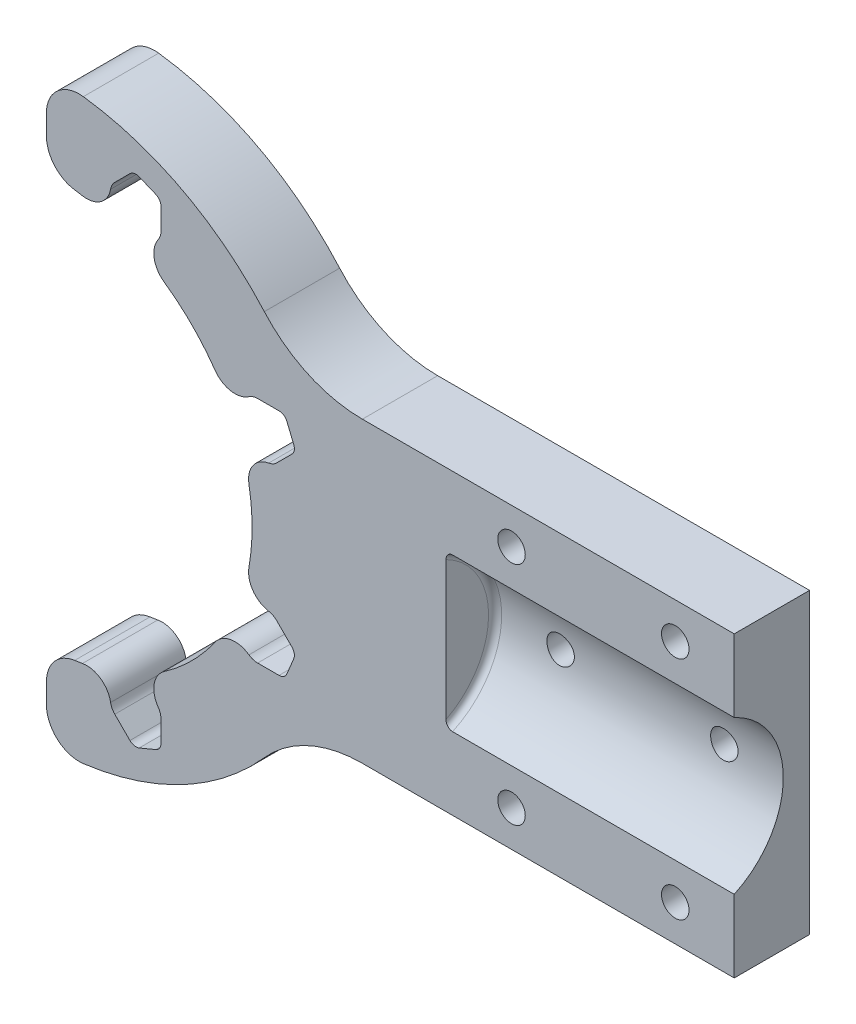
ISO-10303-21;
HEADER;
FILE_DESCRIPTION(('STEP AP214'),'2;1');
FILE_NAME('part.step','',(''),(''),'','','');
FILE_SCHEMA(('AUTOMOTIVE_DESIGN { 1 0 10303 214 1 1 1 1 }'));
ENDSEC;
DATA;
#1=APPLICATION_CONTEXT('core data for automotive mechanical design processes');
#2=APPLICATION_PROTOCOL_DEFINITION('international standard','automotive_design',2000,#1);
#3=PRODUCT_CONTEXT('',#1,'mechanical');
#4=PRODUCT('Part','Part','',(#3));
#5=PRODUCT_RELATED_PRODUCT_CATEGORY('part','',(#4));
#6=PRODUCT_DEFINITION_FORMATION('','',#4);
#7=PRODUCT_DEFINITION_CONTEXT('part definition',#1,'design');
#8=PRODUCT_DEFINITION('design','',#6,#7);
#9=PRODUCT_DEFINITION_SHAPE('','',#8);
#10=(LENGTH_UNIT() NAMED_UNIT(*) SI_UNIT(.MILLI.,.METRE.));
#11=(NAMED_UNIT(*) PLANE_ANGLE_UNIT() SI_UNIT($,.RADIAN.));
#12=(NAMED_UNIT(*) SI_UNIT($,.STERADIAN.) SOLID_ANGLE_UNIT());
#13=UNCERTAINTY_MEASURE_WITH_UNIT(LENGTH_MEASURE(1.E-05),#10,'distance_accuracy_value','');
#14=(GEOMETRIC_REPRESENTATION_CONTEXT(3) GLOBAL_UNCERTAINTY_ASSIGNED_CONTEXT((#13)) GLOBAL_UNIT_ASSIGNED_CONTEXT((#10,
#11,#12)) REPRESENTATION_CONTEXT('',''));
#15=CARTESIAN_POINT('',(0.,0.,0.));
#16=DIRECTION('',(0.,0.,1.));
#17=DIRECTION('',(1.,0.,0.));
#18=AXIS2_PLACEMENT_3D('',#15,#16,#17);
#19=CARTESIAN_POINT('',(50.,-22.75,-11.5));
#20=DIRECTION('',(0.,0.,1.));
#21=DIRECTION('',(1.,0.,0.));
#22=AXIS2_PLACEMENT_3D('',#19,#20,#21);
#23=PLANE('',#22);
#24=CARTESIAN_POINT('',(28.5,0.,-11.5));
#25=DIRECTION('',(0.,0.,1.));
#26=DIRECTION('',(1.,0.,0.));
#27=AXIS2_PLACEMENT_3D('',#24,#25,#26);
#28=CIRCLE('',#27,8.);
#29=CARTESIAN_POINT('',(36.5,0.,-11.5));
#30=VERTEX_POINT('',#29);
#31=EDGE_CURVE('E11',#30,#30,#28,.T.);
#32=ORIENTED_EDGE('',*,*,#31,.T.);
#33=EDGE_LOOP('',(#32));
#34=FACE_BOUND('',#33,.T.);
#35=DIRECTION('',(0.,-1.,0.));
#36=VECTOR('',#35,1.);
#37=CARTESIAN_POINT('',(-55.,44.45,-11.5));
#38=LINE('',#37,#36);
#39=CARTESIAN_POINT('',(-55.,-36.0549580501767,-11.5));
#40=VERTEX_POINT('',#39);
#41=CARTESIAN_POINT('',(-55.,-39.1318604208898,-11.5));
#42=VERTEX_POINT('',#41);
#43=EDGE_CURVE('E752',#40,#42,#38,.T.);
#44=ORIENTED_EDGE('',*,*,#43,.F.);
#45=CARTESIAN_POINT('',(-50.,-36.0549580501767,-11.5));
#46=DIRECTION('',(0.,0.,1.));
#47=DIRECTION('',(1.,0.,0.));
#48=AXIS2_PLACEMENT_3D('',#45,#46,#47);
#49=CIRCLE('',#48,5.);
#50=CARTESIAN_POINT('',(-50.6868131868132,-31.1023539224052,-11.5));
#51=VERTEX_POINT('',#50);
#52=EDGE_CURVE('E1017',#40,#51,#49,.F.);
#53=ORIENTED_EDGE('',*,*,#52,.T.);
#54=CARTESIAN_POINT('',(-55.,0.,-11.5));
#55=DIRECTION('',(0.,0.,1.));
#56=DIRECTION('',(1.,0.,0.));
#57=AXIS2_PLACEMENT_3D('',#54,#55,#56);
#58=CIRCLE('',#57,31.4);
#59=CARTESIAN_POINT('',(-49.5008603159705,-30.9147127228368,-11.5));
#60=VERTEX_POINT('',#59);
#61=EDGE_CURVE('E736',#60,#51,#58,.F.);
#62=ORIENTED_EDGE('',*,*,#61,.F.);
#63=CARTESIAN_POINT('',(-48.8528725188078,-34.5575291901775,-11.5));
#64=DIRECTION('',(0.,0.,1.));
#65=DIRECTION('',(1.,0.,0.));
#66=AXIS2_PLACEMENT_3D('',#63,#64,#65);
#67=CIRCLE('',#66,3.70000000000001);
#68=CARTESIAN_POINT('',(-45.2071050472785,-33.9263560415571,-11.5));
#69=VERTEX_POINT('',#68);
#70=EDGE_CURVE('E1113',#60,#69,#67,.F.);
#71=ORIENTED_EDGE('',*,*,#70,.T.);
#72=CARTESIAN_POINT('',(-42.9408171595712,-33.5340051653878,-11.5));
#73=DIRECTION('',(0.,0.,1.));
#74=DIRECTION('',(1.,0.,0.));
#75=AXIS2_PLACEMENT_3D('',#72,#73,#74);
#76=CIRCLE('',#75,2.29999999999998);
#77=CARTESIAN_POINT('',(-44.5671627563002,-35.1603507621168,-11.5));
#78=VERTEX_POINT('',#77);
#79=EDGE_CURVE('E1120',#78,#69,#76,.F.);
#80=ORIENTED_EDGE('',*,*,#79,.F.);
#81=DIRECTION('',(-0.707106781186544,0.707106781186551,0.));
#82=VECTOR('',#81,1.);
#83=CARTESIAN_POINT('',(-39.8637567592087,-39.8637567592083,-11.5));
#84=LINE('',#83,#82);
#85=CARTESIAN_POINT('',(-42.2549235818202,-37.4725899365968,-11.5));
#86=VERTEX_POINT('',#85);
#87=EDGE_CURVE('E1124',#86,#78,#84,.T.);
#88=ORIENTED_EDGE('',*,*,#87,.F.);
#89=CARTESIAN_POINT('',(-41.3356847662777,-36.5533511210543,-11.5));
#90=DIRECTION('',(0.,0.,1.));
#91=DIRECTION('',(1.,0.,0.));
#92=AXIS2_PLACEMENT_3D('',#89,#90,#91);
#93=CIRCLE('',#92,1.29999999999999);
#94=CARTESIAN_POINT('',(-40.8381963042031,-37.754394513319,-11.5));
#95=VERTEX_POINT('',#94);
#96=EDGE_CURVE('E1122',#95,#86,#93,.F.);
#97=ORIENTED_EDGE('',*,*,#96,.F.);
#98=DIRECTION('',(-0.923879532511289,-0.382683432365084,0.));
#99=VECTOR('',#98,1.);
#100=CARTESIAN_POINT('',(7.36757880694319,-17.7869086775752,-11.5));
#101=LINE('',#100,#99);
#102=CARTESIAN_POINT('',(-38.3175190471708,-36.7102958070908,-11.5));
#103=VERTEX_POINT('',#102);
#104=EDGE_CURVE('E1129',#103,#95,#101,.T.);
#105=ORIENTED_EDGE('',*,*,#104,.F.);
#106=CARTESIAN_POINT('',(-38.8150075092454,-35.5092524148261,-11.5));
#107=DIRECTION('',(0.,0.,1.));
#108=DIRECTION('',(1.,0.,0.));
#109=AXIS2_PLACEMENT_3D('',#106,#107,#108);
#110=CIRCLE('',#109,1.3);
#111=CARTESIAN_POINT('',(-37.5150075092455,-35.5092524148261,-11.5));
#112=VERTEX_POINT('',#111);
#113=EDGE_CURVE('E1131',#112,#103,#110,.F.);
#114=ORIENTED_EDGE('',*,*,#113,.F.);
#115=DIRECTION('',(0.,-1.,0.));
#116=VECTOR('',#115,1.);
#117=CARTESIAN_POINT('',(-37.5150075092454,0.,-11.5));
#118=LINE('',#117,#116);
#119=CARTESIAN_POINT('',(-37.5150075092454,-32.2392524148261,-11.5));
#120=VERTEX_POINT('',#119);
#121=EDGE_CURVE('E1140',#120,#112,#118,.T.);
#122=ORIENTED_EDGE('',*,*,#121,.F.);
#123=CARTESIAN_POINT('',(-39.8150075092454,-32.2392524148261,-11.5));
#124=DIRECTION('',(0.,0.,1.));
#125=DIRECTION('',(1.,0.,0.));
#126=AXIS2_PLACEMENT_3D('',#123,#124,#125);
#127=CIRCLE('',#126,2.3);
#128=CARTESIAN_POINT('',(-37.9350660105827,-30.9141788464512,-11.5));
#129=VERTEX_POINT('',#128);
#130=EDGE_CURVE('E1141',#129,#120,#127,.F.);
#131=ORIENTED_EDGE('',*,*,#130,.F.);
#132=CARTESIAN_POINT('',(-34.9108122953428,-28.7825387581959,-11.5));
#133=DIRECTION('',(0.,0.,1.));
#134=DIRECTION('',(1.,0.,0.));
#135=AXIS2_PLACEMENT_3D('',#132,#133,#134);
#136=CIRCLE('',#135,3.69999999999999);
#137=CARTESIAN_POINT('',(-37.0284759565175,-25.7484819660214,-11.5));
#138=VERTEX_POINT('',#137);
#139=EDGE_CURVE('E1144',#129,#138,#136,.F.);
#140=ORIENTED_EDGE('',*,*,#139,.T.);
#141=CARTESIAN_POINT('',(-55.,0.,-11.5));
#142=DIRECTION('',(0.,0.,1.));
#143=DIRECTION('',(1.,0.,0.));
#144=AXIS2_PLACEMENT_3D('',#141,#142,#143);
#145=CIRCLE('',#144,31.4);
#146=CARTESIAN_POINT('',(-29.2515180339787,-17.9715240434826,-11.5));
#147=VERTEX_POINT('',#146);
#148=EDGE_CURVE('E1150',#147,#138,#145,.F.);
#149=ORIENTED_EDGE('',*,*,#148,.F.);
#150=CARTESIAN_POINT('',(-26.2174612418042,-20.0891877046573,-11.5));
#151=DIRECTION('',(0.,0.,1.));
#152=DIRECTION('',(1.,0.,0.));
#153=AXIS2_PLACEMENT_3D('',#150,#151,#152);
#154=CIRCLE('',#153,3.7);
#155=CARTESIAN_POINT('',(-24.0858211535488,-17.0649339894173,-11.5));
#156=VERTEX_POINT('',#155);
#157=EDGE_CURVE('E1155',#147,#156,#154,.F.);
#158=ORIENTED_EDGE('',*,*,#157,.T.);
#159=CARTESIAN_POINT('',(-22.7607475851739,-15.1849924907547,-11.5));
#160=DIRECTION('',(0.,0.,1.));
#161=DIRECTION('',(1.,0.,0.));
#162=AXIS2_PLACEMENT_3D('',#159,#160,#161);
#163=CIRCLE('',#162,2.3);
#164=CARTESIAN_POINT('',(-22.7607475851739,-17.4849924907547,-11.5));
#165=VERTEX_POINT('',#164);
#166=EDGE_CURVE('E1152',#165,#156,#163,.F.);
#167=ORIENTED_EDGE('',*,*,#166,.F.);
#168=DIRECTION('',(-1.,0.,0.));
#169=VECTOR('',#168,1.);
#170=CARTESIAN_POINT('',(0.,-17.4849924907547,-11.5));
#171=LINE('',#170,#169);
#172=CARTESIAN_POINT('',(-19.4907475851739,-17.4849924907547,-11.5));
#173=VERTEX_POINT('',#172);
#174=EDGE_CURVE('E1160',#173,#165,#171,.T.);
#175=ORIENTED_EDGE('',*,*,#174,.F.);
#176=CARTESIAN_POINT('',(-19.4907475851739,-16.1849924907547,-11.5));
#177=DIRECTION('',(0.,0.,1.));
#178=DIRECTION('',(1.,0.,0.));
#179=AXIS2_PLACEMENT_3D('',#176,#177,#178);
#180=CIRCLE('',#179,1.3);
#181=CARTESIAN_POINT('',(-18.2897041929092,-16.6824809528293,-11.5));
#182=VERTEX_POINT('',#181);
#183=EDGE_CURVE('E1161',#182,#173,#180,.F.);
#184=ORIENTED_EDGE('',*,*,#183,.F.);
#185=DIRECTION('',(-0.382683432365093,-0.923879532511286,0.));
#186=VECTOR('',#185,1.);
#187=CARTESIAN_POINT('',(-9.7130913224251,4.02329415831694,-11.5));
#188=LINE('',#187,#186);
#189=CARTESIAN_POINT('',(-17.245605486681,-14.161803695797,-11.5));
#190=VERTEX_POINT('',#189);
#191=EDGE_CURVE('E1170',#190,#182,#188,.T.);
#192=ORIENTED_EDGE('',*,*,#191,.F.);
#193=CARTESIAN_POINT('',(-18.4466488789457,-13.6643152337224,-11.5));
#194=DIRECTION('',(0.,0.,1.));
#195=DIRECTION('',(1.,0.,0.));
#196=AXIS2_PLACEMENT_3D('',#193,#194,#195);
#197=CIRCLE('',#196,1.3);
#198=CARTESIAN_POINT('',(-17.5274100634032,-12.7450764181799,-11.5));
#199=VERTEX_POINT('',#198);
#200=EDGE_CURVE('E1171',#199,#190,#197,.F.);
#201=ORIENTED_EDGE('',*,*,#200,.F.);
#202=DIRECTION('',(0.707106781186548,-0.707106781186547,0.));
#203=VECTOR('',#202,1.);
#204=CARTESIAN_POINT('',(-15.1362432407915,-15.1362432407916,-11.5));
#205=LINE('',#204,#203);
#206=CARTESIAN_POINT('',(-19.8396492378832,-10.4328372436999,-11.5));
#207=VERTEX_POINT('',#206);
#208=EDGE_CURVE('E1174',#207,#199,#205,.T.);
#209=ORIENTED_EDGE('',*,*,#208,.F.);
#210=CARTESIAN_POINT('',(-21.4659948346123,-12.0591828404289,-11.5));
#211=DIRECTION('',(0.,0.,1.));
#212=DIRECTION('',(1.,0.,0.));
#213=AXIS2_PLACEMENT_3D('',#210,#211,#212);
#214=CIRCLE('',#213,2.3);
#215=CARTESIAN_POINT('',(-21.0736439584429,-9.79289495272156,-11.5));
#216=VERTEX_POINT('',#215);
#217=EDGE_CURVE('E1178',#216,#207,#214,.F.);
#218=ORIENTED_EDGE('',*,*,#217,.F.);
#219=CARTESIAN_POINT('',(-20.4424708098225,-6.14712748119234,-11.5));
#220=DIRECTION('',(0.,0.,1.));
#221=DIRECTION('',(1.,0.,0.));
#222=AXIS2_PLACEMENT_3D('',#219,#220,#221);
#223=CIRCLE('',#222,3.69999999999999);
#224=CARTESIAN_POINT('',(-24.0852872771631,-5.49913968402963,-11.5));
#225=VERTEX_POINT('',#224);
#226=EDGE_CURVE('E1184',#216,#225,#223,.F.);
#227=ORIENTED_EDGE('',*,*,#226,.T.);
#228=CARTESIAN_POINT('',(-55.,0.,-11.5));
#229=DIRECTION('',(0.,0.,1.));
#230=DIRECTION('',(1.,0.,0.));
#231=AXIS2_PLACEMENT_3D('',#228,#229,#230);
#232=CIRCLE('',#231,31.4);
#233=CARTESIAN_POINT('',(-24.0852872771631,5.49913968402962,-11.5));
#234=VERTEX_POINT('',#233);
#235=EDGE_CURVE('E1187',#234,#225,#232,.F.);
#236=ORIENTED_EDGE('',*,*,#235,.F.);
#237=CARTESIAN_POINT('',(-20.4424708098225,6.14712748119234,-11.5));
#238=DIRECTION('',(0.,0.,1.));
#239=DIRECTION('',(1.,0.,0.));
#240=AXIS2_PLACEMENT_3D('',#237,#238,#239);
#241=CIRCLE('',#240,3.7);
#242=CARTESIAN_POINT('',(-21.0736439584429,9.79289495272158,-11.5));
#243=VERTEX_POINT('',#242);
#244=EDGE_CURVE('E1188',#234,#243,#241,.F.);
#245=ORIENTED_EDGE('',*,*,#244,.T.);
#246=CARTESIAN_POINT('',(-21.4659948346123,12.0591828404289,-11.5));
#247=DIRECTION('',(0.,0.,1.));
#248=DIRECTION('',(1.,0.,0.));
#249=AXIS2_PLACEMENT_3D('',#246,#247,#248);
#250=CIRCLE('',#249,2.29999999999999);
#251=CARTESIAN_POINT('',(-19.8396492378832,10.4328372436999,-11.5));
#252=VERTEX_POINT('',#251);
#253=EDGE_CURVE('E1193',#252,#243,#250,.F.);
#254=ORIENTED_EDGE('',*,*,#253,.F.);
#255=DIRECTION('',(-0.707106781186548,-0.707106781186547,0.));
#256=VECTOR('',#255,1.);
#257=CARTESIAN_POINT('',(-15.1362432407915,15.1362432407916,-11.5));
#258=LINE('',#257,#256);
#259=CARTESIAN_POINT('',(-17.5274100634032,12.7450764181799,-11.5));
#260=VERTEX_POINT('',#259);
#261=EDGE_CURVE('E1196',#260,#252,#258,.T.);
#262=ORIENTED_EDGE('',*,*,#261,.F.);
#263=CARTESIAN_POINT('',(-18.4466488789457,13.6643152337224,-11.5));
#264=DIRECTION('',(0.,0.,1.));
#265=DIRECTION('',(1.,0.,0.));
#266=AXIS2_PLACEMENT_3D('',#263,#264,#265);
#267=CIRCLE('',#266,1.3);
#268=CARTESIAN_POINT('',(-17.245605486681,14.161803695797,-11.5));
#269=VERTEX_POINT('',#268);
#270=EDGE_CURVE('E1203',#269,#260,#267,.F.);
#271=ORIENTED_EDGE('',*,*,#270,.F.);
#272=DIRECTION('',(0.38268343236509,-0.923879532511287,0.));
#273=VECTOR('',#272,1.);
#274=CARTESIAN_POINT('',(-9.71309132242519,-4.02329415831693,-11.5));
#275=LINE('',#274,#273);
#276=CARTESIAN_POINT('',(-18.2897041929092,16.6824809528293,-11.5));
#277=VERTEX_POINT('',#276);
#278=EDGE_CURVE('E1202',#277,#269,#275,.T.);
#279=ORIENTED_EDGE('',*,*,#278,.F.);
#280=CARTESIAN_POINT('',(-19.4907475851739,16.1849924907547,-11.5));
#281=DIRECTION('',(0.,0.,1.));
#282=DIRECTION('',(1.,0.,0.));
#283=AXIS2_PLACEMENT_3D('',#280,#281,#282);
#284=CIRCLE('',#283,1.3);
#285=CARTESIAN_POINT('',(-19.4907475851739,17.4849924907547,-11.5));
#286=VERTEX_POINT('',#285);
#287=EDGE_CURVE('E1209',#286,#277,#284,.F.);
#288=ORIENTED_EDGE('',*,*,#287,.F.);
#289=DIRECTION('',(1.,0.,0.));
#290=VECTOR('',#289,1.);
#291=CARTESIAN_POINT('',(0.,17.4849924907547,-11.5));
#292=LINE('',#291,#290);
#293=CARTESIAN_POINT('',(-22.7607475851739,17.4849924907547,-11.5));
#294=VERTEX_POINT('',#293);
#295=EDGE_CURVE('E1214',#294,#286,#292,.T.);
#296=ORIENTED_EDGE('',*,*,#295,.F.);
#297=CARTESIAN_POINT('',(-22.7607475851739,15.1849924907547,-11.5));
#298=DIRECTION('',(0.,0.,1.));
#299=DIRECTION('',(1.,0.,0.));
#300=AXIS2_PLACEMENT_3D('',#297,#298,#299);
#301=CIRCLE('',#300,2.30000000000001);
#302=CARTESIAN_POINT('',(-24.0858211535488,17.0649339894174,-11.5));
#303=VERTEX_POINT('',#302);
#304=EDGE_CURVE('E1220',#303,#294,#301,.F.);
#305=ORIENTED_EDGE('',*,*,#304,.F.);
#306=CARTESIAN_POINT('',(-26.2174612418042,20.0891877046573,-11.5));
#307=DIRECTION('',(0.,0.,1.));
#308=DIRECTION('',(1.,0.,0.));
#309=AXIS2_PLACEMENT_3D('',#306,#307,#308);
#310=CIRCLE('',#309,3.69999999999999);
#311=CARTESIAN_POINT('',(-29.2515180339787,17.9715240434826,-11.5));
#312=VERTEX_POINT('',#311);
#313=EDGE_CURVE('E1224',#303,#312,#310,.F.);
#314=ORIENTED_EDGE('',*,*,#313,.T.);
#315=CARTESIAN_POINT('',(-55.,0.,-11.5));
#316=DIRECTION('',(0.,0.,1.));
#317=DIRECTION('',(1.,0.,0.));
#318=AXIS2_PLACEMENT_3D('',#315,#316,#317);
#319=CIRCLE('',#318,31.4);
#320=CARTESIAN_POINT('',(-37.0284759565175,25.7484819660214,-11.5));
#321=VERTEX_POINT('',#320);
#322=EDGE_CURVE('E1223',#321,#312,#319,.F.);
#323=ORIENTED_EDGE('',*,*,#322,.F.);
#324=CARTESIAN_POINT('',(-34.9108122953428,28.7825387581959,-11.5));
#325=DIRECTION('',(0.,0.,1.));
#326=DIRECTION('',(1.,0.,0.));
#327=AXIS2_PLACEMENT_3D('',#324,#325,#326);
#328=CIRCLE('',#327,3.7);
#329=CARTESIAN_POINT('',(-37.9350660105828,30.9141788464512,-11.5));
#330=VERTEX_POINT('',#329);
#331=EDGE_CURVE('E1226',#321,#330,#328,.F.);
#332=ORIENTED_EDGE('',*,*,#331,.T.);
#333=CARTESIAN_POINT('',(-39.8150075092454,32.2392524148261,-11.5));
#334=DIRECTION('',(0.,0.,1.));
#335=DIRECTION('',(1.,0.,0.));
#336=AXIS2_PLACEMENT_3D('',#333,#334,#335);
#337=CIRCLE('',#336,2.29999999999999);
#338=CARTESIAN_POINT('',(-37.5150075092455,32.2392524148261,-11.5));
#339=VERTEX_POINT('',#338);
#340=EDGE_CURVE('E1233',#339,#330,#337,.F.);
#341=ORIENTED_EDGE('',*,*,#340,.F.);
#342=DIRECTION('',(0.,-1.,0.));
#343=VECTOR('',#342,1.);
#344=CARTESIAN_POINT('',(-37.5150075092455,0.,-11.5));
#345=LINE('',#344,#343);
#346=CARTESIAN_POINT('',(-37.5150075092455,35.5092524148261,-11.5));
#347=VERTEX_POINT('',#346);
#348=EDGE_CURVE('E1234',#347,#339,#345,.T.);
#349=ORIENTED_EDGE('',*,*,#348,.F.);
#350=CARTESIAN_POINT('',(-38.8150075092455,35.5092524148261,-11.5));
#351=DIRECTION('',(0.,0.,1.));
#352=DIRECTION('',(1.,0.,0.));
#353=AXIS2_PLACEMENT_3D('',#350,#351,#352);
#354=CIRCLE('',#353,1.3);
#355=CARTESIAN_POINT('',(-38.3175190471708,36.7102958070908,-11.5));
#356=VERTEX_POINT('',#355);
#357=EDGE_CURVE('E1239',#356,#347,#354,.F.);
#358=ORIENTED_EDGE('',*,*,#357,.F.);
#359=DIRECTION('',(0.923879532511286,-0.382683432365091,0.));
#360=VECTOR('',#359,1.);
#361=CARTESIAN_POINT('',(7.36757880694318,17.7869086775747,-11.5));
#362=LINE('',#361,#360);
#363=CARTESIAN_POINT('',(-40.8381963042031,37.754394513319,-11.5));
#364=VERTEX_POINT('',#363);
#365=EDGE_CURVE('E1243',#364,#356,#362,.T.);
#366=ORIENTED_EDGE('',*,*,#365,.F.);
#367=CARTESIAN_POINT('',(-41.3356847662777,36.5533511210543,-11.5));
#368=DIRECTION('',(0.,0.,1.));
#369=DIRECTION('',(1.,0.,0.));
#370=AXIS2_PLACEMENT_3D('',#367,#368,#369);
#371=CIRCLE('',#370,1.30000000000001);
#372=CARTESIAN_POINT('',(-42.2549235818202,37.4725899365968,-11.5));
#373=VERTEX_POINT('',#372);
#374=EDGE_CURVE('E1250',#373,#364,#371,.F.);
#375=ORIENTED_EDGE('',*,*,#374,.F.);
#376=DIRECTION('',(0.707106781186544,0.707106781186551,0.));
#377=VECTOR('',#376,1.);
#378=CARTESIAN_POINT('',(-39.8637567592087,39.8637567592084,-11.5));
#379=LINE('',#378,#377);
#380=CARTESIAN_POINT('',(-44.5671627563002,35.1603507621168,-11.5));
#381=VERTEX_POINT('',#380);
#382=EDGE_CURVE('E1251',#381,#373,#379,.T.);
#383=ORIENTED_EDGE('',*,*,#382,.F.);
#384=CARTESIAN_POINT('',(-42.9408171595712,33.5340051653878,-11.5));
#385=DIRECTION('',(0.,0.,1.));
#386=DIRECTION('',(1.,0.,0.));
#387=AXIS2_PLACEMENT_3D('',#384,#385,#386);
#388=CIRCLE('',#387,2.3);
#389=CARTESIAN_POINT('',(-45.2071050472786,33.9263560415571,-11.5));
#390=VERTEX_POINT('',#389);
#391=EDGE_CURVE('E1254',#390,#381,#388,.F.);
#392=ORIENTED_EDGE('',*,*,#391,.F.);
#393=CARTESIAN_POINT('',(-48.8528725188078,34.5575291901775,-11.5));
#394=DIRECTION('',(0.,0.,1.));
#395=DIRECTION('',(1.,0.,0.));
#396=AXIS2_PLACEMENT_3D('',#393,#394,#395);
#397=CIRCLE('',#396,3.69999999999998);
#398=CARTESIAN_POINT('',(-49.5008603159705,30.9147127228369,-11.5));
#399=VERTEX_POINT('',#398);
#400=EDGE_CURVE('E1256',#390,#399,#397,.F.);
#401=ORIENTED_EDGE('',*,*,#400,.T.);
#402=CARTESIAN_POINT('',(-55.,0.,-11.5));
#403=DIRECTION('',(0.,0.,1.));
#404=DIRECTION('',(1.,0.,0.));
#405=AXIS2_PLACEMENT_3D('',#402,#403,#404);
#406=CIRCLE('',#405,31.4);
#407=CARTESIAN_POINT('',(-50.6868131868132,31.1023539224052,-11.5));
#408=VERTEX_POINT('',#407);
#409=EDGE_CURVE('E416',#408,#399,#406,.F.);
#410=ORIENTED_EDGE('',*,*,#409,.F.);
#411=CARTESIAN_POINT('',(-50.,36.0549580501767,-11.5));
#412=DIRECTION('',(0.,0.,1.));
#413=DIRECTION('',(1.,0.,0.));
#414=AXIS2_PLACEMENT_3D('',#411,#412,#413);
#415=CIRCLE('',#414,5.);
#416=CARTESIAN_POINT('',(-55.,36.0549580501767,-11.5));
#417=VERTEX_POINT('',#416);
#418=EDGE_CURVE('E1102',#408,#417,#415,.F.);
#419=ORIENTED_EDGE('',*,*,#418,.T.);
#420=CARTESIAN_POINT('',(-55.,39.1318604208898,-11.5));
#421=VERTEX_POINT('',#420);
#422=EDGE_CURVE('E760',#421,#417,#38,.T.);
#423=ORIENTED_EDGE('',*,*,#422,.F.);
#424=CARTESIAN_POINT('',(-50.,39.1318604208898,-11.5));
#425=DIRECTION('',(0.,0.,1.));
#426=DIRECTION('',(1.,0.,0.));
#427=AXIS2_PLACEMENT_3D('',#424,#425,#426);
#428=CIRCLE('',#427,5.);
#429=CARTESIAN_POINT('',(-49.3662864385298,44.0915385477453,-11.5));
#430=VERTEX_POINT('',#429);
#431=EDGE_CURVE('E74',#421,#430,#428,.F.);
#432=ORIENTED_EDGE('',*,*,#431,.T.);
#433=CARTESIAN_POINT('',(-55.,0.,-11.5));
#434=DIRECTION('',(0.,0.,1.));
#435=DIRECTION('',(-1.,0.,0.));
#436=AXIS2_PLACEMENT_3D('',#433,#434,#435);
#437=CIRCLE('',#436,44.45);
#438=CARTESIAN_POINT('',(-21.7358750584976,29.4839022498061,-11.5));
#439=VERTEX_POINT('',#438);
#440=EDGE_CURVE('E755',#439,#430,#437,.T.);
#441=ORIENTED_EDGE('',*,*,#440,.F.);
#442=CARTESIAN_POINT('',(-6.76888970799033,42.75,-11.5));
#443=DIRECTION('',(0.,0.,1.));
#444=DIRECTION('',(1.,0.,0.));
#445=AXIS2_PLACEMENT_3D('',#442,#443,#444);
#446=CIRCLE('',#445,20.);
#447=CARTESIAN_POINT('',(-6.76888970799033,22.75,-11.5));
#448=VERTEX_POINT('',#447);
#449=EDGE_CURVE('E838',#439,#448,#446,.T.);
#450=ORIENTED_EDGE('',*,*,#449,.T.);
#451=DIRECTION('',(-1.,0.,0.));
#452=VECTOR('',#451,1.);
#453=CARTESIAN_POINT('',(50.,22.75,-11.5));
#454=LINE('',#453,#452);
#455=CARTESIAN_POINT('',(50.,22.75,-11.5));
#456=VERTEX_POINT('',#455);
#457=EDGE_CURVE('E799',#456,#448,#454,.T.);
#458=ORIENTED_EDGE('',*,*,#457,.F.);
#459=DIRECTION('',(0.,1.,0.));
#460=VECTOR('',#459,1.);
#461=CARTESIAN_POINT('',(50.,-22.75,-11.5));
#462=LINE('',#461,#460);
#463=CARTESIAN_POINT('',(50.,-22.75,-11.5));
#464=VERTEX_POINT('',#463);
#465=EDGE_CURVE('E781',#464,#456,#462,.T.);
#466=ORIENTED_EDGE('',*,*,#465,.F.);
#467=DIRECTION('',(-1.,0.,0.));
#468=VECTOR('',#467,1.);
#469=CARTESIAN_POINT('',(50.,-22.75,-11.5));
#470=LINE('',#469,#468);
#471=CARTESIAN_POINT('',(-6.76888970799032,-22.75,-11.5));
#472=VERTEX_POINT('',#471);
#473=EDGE_CURVE('E803',#464,#472,#470,.T.);
#474=ORIENTED_EDGE('',*,*,#473,.T.);
#475=CARTESIAN_POINT('',(-6.76888970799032,-42.75,-11.5));
#476=DIRECTION('',(0.,0.,1.));
#477=DIRECTION('',(1.,0.,0.));
#478=AXIS2_PLACEMENT_3D('',#475,#476,#477);
#479=CIRCLE('',#478,20.);
#480=CARTESIAN_POINT('',(-21.7358750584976,-29.483902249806,-11.5));
#481=VERTEX_POINT('',#480);
#482=EDGE_CURVE('E831',#472,#481,#479,.T.);
#483=ORIENTED_EDGE('',*,*,#482,.T.);
#484=CARTESIAN_POINT('',(-55.,0.,-11.5));
#485=DIRECTION('',(0.,0.,1.));
#486=DIRECTION('',(-1.,0.,0.));
#487=AXIS2_PLACEMENT_3D('',#484,#485,#486);
#488=CIRCLE('',#487,44.45);
#489=CARTESIAN_POINT('',(-49.3662864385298,-44.0915385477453,-11.5));
#490=VERTEX_POINT('',#489);
#491=EDGE_CURVE('E762',#490,#481,#488,.T.);
#492=ORIENTED_EDGE('',*,*,#491,.F.);
#493=CARTESIAN_POINT('',(-50.,-39.1318604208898,-11.5));
#494=DIRECTION('',(0.,0.,1.));
#495=DIRECTION('',(1.,0.,0.));
#496=AXIS2_PLACEMENT_3D('',#493,#494,#495);
#497=CIRCLE('',#496,5.);
#498=EDGE_CURVE('E1016',#490,#42,#497,.F.);
#499=ORIENTED_EDGE('',*,*,#498,.T.);
#500=EDGE_LOOP('',(#44,#53,#62,#71,#80,#88,#97,#105,#114,#122,#131,#140,#149,#158,#167,#175,
#184,#192,#201,#209,#218,#227,#236,#245,#254,#262,#271,#279,#288,#296,#305,#314,#323,#332,#341,
#349,#358,#366,#375,#383,#392,#401,#410,#419,#423,#432,#441,#450,#458,#466,#474,#483,#492,#499));
#501=FACE_BOUND('',#500,.T.);
#502=CARTESIAN_POINT('',(41.,-17.25,-11.5));
#503=DIRECTION('',(0.,0.,1.));
#504=DIRECTION('',(1.,0.,0.));
#505=AXIS2_PLACEMENT_3D('',#502,#503,#504);
#506=CIRCLE('',#505,2.1);
#507=CARTESIAN_POINT('',(43.1,-17.25,-11.5));
#508=VERTEX_POINT('',#507);
#509=EDGE_CURVE('E733',#508,#508,#506,.T.);
#510=ORIENTED_EDGE('',*,*,#509,.T.);
#511=EDGE_LOOP('',(#510));
#512=FACE_BOUND('',#511,.T.);
#513=CARTESIAN_POINT('',(16.,-17.25,-11.5));
#514=DIRECTION('',(0.,0.,1.));
#515=DIRECTION('',(1.,0.,0.));
#516=AXIS2_PLACEMENT_3D('',#513,#514,#515);
#517=CIRCLE('',#516,2.1);
#518=CARTESIAN_POINT('',(18.1,-17.25,-11.5));
#519=VERTEX_POINT('',#518);
#520=EDGE_CURVE('E730',#519,#519,#517,.T.);
#521=ORIENTED_EDGE('',*,*,#520,.T.);
#522=EDGE_LOOP('',(#521));
#523=FACE_BOUND('',#522,.T.);
#524=CARTESIAN_POINT('',(16.,17.25,-11.5));
#525=DIRECTION('',(0.,0.,1.));
#526=DIRECTION('',(1.,0.,0.));
#527=AXIS2_PLACEMENT_3D('',#524,#525,#526);
#528=CIRCLE('',#527,2.1);
#529=CARTESIAN_POINT('',(18.1,17.25,-11.5));
#530=VERTEX_POINT('',#529);
#531=EDGE_CURVE('E717',#530,#530,#528,.T.);
#532=ORIENTED_EDGE('',*,*,#531,.T.);
#533=EDGE_LOOP('',(#532));
#534=FACE_BOUND('',#533,.T.);
#535=CARTESIAN_POINT('',(41.,17.25,-11.5));
#536=DIRECTION('',(0.,0.,1.));
#537=DIRECTION('',(1.,0.,0.));
#538=AXIS2_PLACEMENT_3D('',#535,#536,#537);
#539=CIRCLE('',#538,2.1);
#540=CARTESIAN_POINT('',(43.1,17.25,-11.5));
#541=VERTEX_POINT('',#540);
#542=EDGE_CURVE('E738',#541,#541,#539,.T.);
#543=ORIENTED_EDGE('',*,*,#542,.T.);
#544=EDGE_LOOP('',(#543));
#545=FACE_BOUND('',#544,.T.);
#546=CARTESIAN_POINT('',(41.,0.,-11.500012));
#547=DIRECTION('',(0.,0.,-1.));
#548=DIRECTION('',(-1.,0.,0.));
#549=AXIS2_PLACEMENT_3D('',#546,#547,#548);
#550=CIRCLE('',#549,2.1);
#551=CARTESIAN_POINT('',(38.9,0.,-11.500012));
#552=VERTEX_POINT('',#551);
#553=EDGE_CURVE('E941',#552,#552,#550,.T.);
#554=ORIENTED_EDGE('',*,*,#553,.F.);
#555=EDGE_LOOP('',(#554));
#556=FACE_BOUND('',#555,.T.);
#557=CARTESIAN_POINT('',(16.,0.,-11.500012));
#558=DIRECTION('',(0.,0.,-1.));
#559=DIRECTION('',(-1.,0.,0.));
#560=AXIS2_PLACEMENT_3D('',#557,#558,#559);
#561=CIRCLE('',#560,2.1);
#562=CARTESIAN_POINT('',(13.9,0.,-11.500012));
#563=VERTEX_POINT('',#562);
#564=EDGE_CURVE('E946',#563,#563,#561,.T.);
#565=ORIENTED_EDGE('',*,*,#564,.F.);
#566=EDGE_LOOP('',(#565));
#567=FACE_BOUND('',#566,.T.);
#568=ADVANCED_FACE('F50',(#34,#501,#512,#523,#534,#545,#556,#567),#23,.F.);
#569=CARTESIAN_POINT('',(-55.,44.45,-11.5));
#570=DIRECTION('',(-1.,0.,0.));
#571=DIRECTION('',(0.,0.,1.));
#572=AXIS2_PLACEMENT_3D('',#569,#570,#571);
#573=PLANE('',#572);
#574=DIRECTION('',(0.,-1.,0.));
#575=VECTOR('',#574,1.);
#576=CARTESIAN_POINT('',(-55.,44.45,0.));
#577=LINE('',#576,#575);
#578=CARTESIAN_POINT('',(-55.,-36.0549580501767,0.));
#579=VERTEX_POINT('',#578);
#580=CARTESIAN_POINT('',(-55.,-39.1318604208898,0.));
#581=VERTEX_POINT('',#580);
#582=EDGE_CURVE('E768',#579,#581,#577,.T.);
#583=ORIENTED_EDGE('',*,*,#582,.F.);
#584=DIRECTION('',(0.,0.,-1.));
#585=VECTOR('',#584,1.);
#586=CARTESIAN_POINT('',(-55.,-36.0549580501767,-11.5));
#587=LINE('',#586,#585);
#588=EDGE_CURVE('E1098',#579,#40,#587,.T.);
#589=ORIENTED_EDGE('',*,*,#588,.T.);
#590=ORIENTED_EDGE('',*,*,#43,.T.);
#591=DIRECTION('',(0.,0.,1.));
#592=VECTOR('',#591,1.);
#593=CARTESIAN_POINT('',(-55.,-39.1318604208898,-11.5));
#594=LINE('',#593,#592);
#595=EDGE_CURVE('E1094',#42,#581,#594,.T.);
#596=ORIENTED_EDGE('',*,*,#595,.T.);
#597=EDGE_LOOP('',(#583,#589,#590,#596));
#598=FACE_BOUND('',#597,.T.);
#599=ADVANCED_FACE('F903',(#598),#573,.T.);
#600=CARTESIAN_POINT('',(50.,0.,5.35));
#601=DIRECTION('',(-1.,0.,0.));
#602=DIRECTION('',(0.,0.,1.));
#603=AXIS2_PLACEMENT_3D('',#600,#601,#602);
#604=CYLINDRICAL_SURFACE('',#603,12.85);
#605=CARTESIAN_POINT('',(13.9,0.,-7.5));
#606=CARTESIAN_POINT('',(13.9000047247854,0.117121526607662,-7.49999801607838));
#607=CARTESIAN_POINT('',(13.9098312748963,0.234307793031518,-7.49838204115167));
#608=CARTESIAN_POINT('',(13.9488627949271,0.465395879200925,-7.49209118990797));
#609=CARTESIAN_POINT('',(13.9780857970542,0.57929453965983,-7.48741346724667));
#610=CARTESIAN_POINT('',(14.0550062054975,0.800430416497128,-7.47552399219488));
#611=CARTESIAN_POINT('',(14.1026887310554,0.907672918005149,-7.46831428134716));
#612=CARTESIAN_POINT('',(14.2151362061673,1.11262082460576,-7.45215435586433));
#613=CARTESIAN_POINT('',(14.2798991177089,1.21032736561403,-7.44320434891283));
#614=CARTESIAN_POINT('',(14.4253034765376,1.3943436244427,-7.42446448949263));
#615=CARTESIAN_POINT('',(14.5060713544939,1.48055280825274,-7.41466832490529));
#616=CARTESIAN_POINT('',(14.680920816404,1.63825897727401,-7.39538877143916));
#617=CARTESIAN_POINT('',(14.775003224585,1.70975505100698,-7.38590540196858));
#618=CARTESIAN_POINT('',(14.9744986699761,1.83640607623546,-7.36826403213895));
#619=CARTESIAN_POINT('',(15.0799753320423,1.89146204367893,-7.36011418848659));
#620=CARTESIAN_POINT('',(15.2988349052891,1.98303711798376,-7.34614992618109));
#621=CARTESIAN_POINT('',(15.4122173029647,2.01955742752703,-7.34033535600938));
#622=CARTESIAN_POINT('',(15.6426057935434,2.07270865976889,-7.33176266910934));
#623=CARTESIAN_POINT('',(15.7595709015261,2.08951286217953,-7.32897793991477));
#624=CARTESIAN_POINT('',(15.9946912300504,2.10329203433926,-7.32669967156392));
#625=CARTESIAN_POINT('',(16.1128463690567,2.10026835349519,-7.32720590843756));
#626=CARTESIAN_POINT('',(16.345758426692,2.07461882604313,-7.33142806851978));
#627=CARTESIAN_POINT('',(16.4605374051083,2.05218729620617,-7.33511217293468));
#628=CARTESIAN_POINT('',(16.6846804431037,1.98866361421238,-7.34522517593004));
#629=CARTESIAN_POINT('',(16.7940443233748,1.94757084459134,-7.35165416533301));
#630=CARTESIAN_POINT('',(17.0048363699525,1.84769311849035,-7.36656708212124));
#631=CARTESIAN_POINT('',(17.1062254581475,1.78882714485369,-7.37506038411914));
#632=CARTESIAN_POINT('',(17.2977604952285,1.65513155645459,-7.39313838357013));
#633=CARTESIAN_POINT('',(17.387905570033,1.58030070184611,-7.40272316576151));
#634=CARTESIAN_POINT('',(17.5555187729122,1.41573919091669,-7.42204413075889));
#635=CARTESIAN_POINT('',(17.6328231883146,1.32584174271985,-7.43178075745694));
#636=CARTESIAN_POINT('',(17.7712743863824,1.13426388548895,-7.45020275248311));
#637=CARTESIAN_POINT('',(17.8324210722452,1.03258340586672,-7.45888811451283));
#638=CARTESIAN_POINT('',(17.9368346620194,0.82017432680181,-7.47424062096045));
#639=CARTESIAN_POINT('',(17.9800874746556,0.70943867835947,-7.48090617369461));
#640=CARTESIAN_POINT('',(18.0473355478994,0.482141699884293,-7.4914551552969));
#641=CARTESIAN_POINT('',(18.071332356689,0.365580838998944,-7.49533880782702));
#642=CARTESIAN_POINT('',(18.0991661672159,0.13135360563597,-7.49985642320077));
#643=CARTESIAN_POINT('',(18.1032279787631,0.0137146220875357,-7.50052662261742));
#644=CARTESIAN_POINT('',(18.0916753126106,-0.220563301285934,-7.49864094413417));
#645=CARTESIAN_POINT('',(18.0760615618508,-0.337202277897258,-7.49608518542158));
#646=CARTESIAN_POINT('',(18.0257879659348,-0.565477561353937,-7.48805718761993));
#647=CARTESIAN_POINT('',(17.9912390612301,-0.67713895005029,-7.4826019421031));
#648=CARTESIAN_POINT('',(17.904193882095,-0.893084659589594,-7.46938429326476));
#649=CARTESIAN_POINT('',(17.8516966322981,-0.997368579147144,-7.46162176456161));
#650=CARTESIAN_POINT('',(17.7297275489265,-1.19657805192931,-7.44456106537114));
#651=CARTESIAN_POINT('',(17.6601148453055,-1.29141626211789,-7.43525036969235));
#652=CARTESIAN_POINT('',(17.506085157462,-1.46814485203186,-7.41616490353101));
#653=CARTESIAN_POINT('',(17.4216671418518,-1.55003432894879,-7.40639010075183));
#654=CARTESIAN_POINT('',(17.2394163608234,-1.69937114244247,-7.38736138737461));
#655=CARTESIAN_POINT('',(17.1414585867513,-1.76666682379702,-7.37811362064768));
#656=CARTESIAN_POINT('',(16.9354969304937,-1.88384763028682,-7.36129958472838));
#657=CARTESIAN_POINT('',(16.8274933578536,-1.93373329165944,-7.35373326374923));
#658=CARTESIAN_POINT('',(16.6049356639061,-2.01444949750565,-7.34118458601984));
#659=CARTESIAN_POINT('',(16.490409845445,-2.04535640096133,-7.3361918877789));
#660=CARTESIAN_POINT('',(16.2577041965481,-2.0874786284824,-7.3293294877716));
#661=CARTESIAN_POINT('',(16.1395246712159,-2.09869559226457,-7.32745952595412));
#662=CARTESIAN_POINT('',(15.9043800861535,-2.10107515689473,-7.32706523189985));
#663=CARTESIAN_POINT('',(15.7874174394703,-2.09247641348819,-7.32850108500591));
#664=CARTESIAN_POINT('',(15.5566266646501,-2.05598376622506,-7.33446952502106));
#665=CARTESIAN_POINT('',(15.4427985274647,-2.02808991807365,-7.33900210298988));
#666=CARTESIAN_POINT('',(15.221594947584,-1.9538888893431,-7.35063839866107));
#667=CARTESIAN_POINT('',(15.1142127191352,-1.9076014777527,-7.35773935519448));
#668=CARTESIAN_POINT('',(14.9086994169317,-1.79795159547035,-7.37371511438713));
#669=CARTESIAN_POINT('',(14.8105687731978,-1.73458833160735,-7.38258999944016));
#670=CARTESIAN_POINT('',(14.6251370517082,-1.59173052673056,-7.40124023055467));
#671=CARTESIAN_POINT('',(14.5379723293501,-1.51206016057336,-7.41102469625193));
#672=CARTESIAN_POINT('',(14.3781668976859,-1.33922073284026,-7.43031820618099));
#673=CARTESIAN_POINT('',(14.3055295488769,-1.24604855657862,-7.43982718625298));
#674=CARTESIAN_POINT('',(14.176403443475,-1.0481190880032,-7.45757102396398));
#675=CARTESIAN_POINT('',(14.1200246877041,-0.943289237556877,-7.46579703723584));
#676=CARTESIAN_POINT('',(14.0257628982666,-0.72555668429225,-7.47996193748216));
#677=CARTESIAN_POINT('',(13.9878612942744,-0.612662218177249,-7.48590311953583));
#678=CARTESIAN_POINT('',(13.939931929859,-0.416095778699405,-7.4935203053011));
#679=CARTESIAN_POINT('',(13.9249812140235,-0.333618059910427,-7.49593730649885));
#680=CARTESIAN_POINT('',(13.9050136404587,-0.167437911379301,-7.49917785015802));
#681=CARTESIAN_POINT('',(13.8999966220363,-0.0837355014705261,-7.50000141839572));
#682=CARTESIAN_POINT('',(13.9,0.,-7.5));
#683=B_SPLINE_CURVE_WITH_KNOTS('',3,(#605,#606,#607,#608,#609,#610,#611,#612,#613,#614,#615,
#616,#617,#618,#619,#620,#621,#622,#623,#624,#625,#626,#627,#628,#629,#630,#631,#632,#633,#634,
#635,#636,#637,#638,#639,#640,#641,#642,#643,#644,#645,#646,#647,#648,#649,#650,#651,#652,#653,
#654,#655,#656,#657,#658,#659,#660,#661,#662,#663,#664,#665,#666,#667,#668,#669,#670,#671,#672,
#673,#674,#675,#676,#677,#678,#679,#680,#681,#682),.UNSPECIFIED.,.T.,.F.,(4,2,2,2,2,2,2,2,2,2,2,
2,2,2,2,2,2,2,2,2,2,2,2,2,2,2,2,2,2,2,2,2,2,2,2,2,2,2,4),(0.,0.351058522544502,
0.702443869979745,1.05354654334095,1.40460734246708,1.75856061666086,2.11253581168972,
2.46860116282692,2.82464340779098,3.17753247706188,3.53039753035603,3.87976995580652,
4.22915394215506,4.58015523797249,4.93118380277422,5.28639177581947,5.64160187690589,
5.99709117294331,6.35255188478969,6.70399465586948,7.05542444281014,7.40481689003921,
7.75422832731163,8.10661799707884,8.45903222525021,8.81494965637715,9.17085612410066,
9.52532109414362,9.87975654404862,10.2299456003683,10.5801336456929,10.9299463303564,
11.2797752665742,11.6335961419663,11.9874987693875,12.343742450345,12.6996273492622,
12.9506190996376,13.2016067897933),.UNSPECIFIED.);
#684=CARTESIAN_POINT('',(13.9,0.,-7.5));
#685=VERTEX_POINT('',#684);
#686=EDGE_CURVE('E433',#685,#685,#683,.T.);
#687=ORIENTED_EDGE('',*,*,#686,.T.);
#688=EDGE_LOOP('',(#687));
#689=FACE_BOUND('',#688,.T.);
#690=CARTESIAN_POINT('',(38.9,0.,-7.5));
#691=CARTESIAN_POINT('',(38.9000047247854,0.117121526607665,-7.49999801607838));
#692=CARTESIAN_POINT('',(38.9098312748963,0.234307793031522,-7.49838204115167));
#693=CARTESIAN_POINT('',(38.9488627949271,0.465395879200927,-7.49209118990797));
#694=CARTESIAN_POINT('',(38.9780857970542,0.579294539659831,-7.48741346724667));
#695=CARTESIAN_POINT('',(39.0550062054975,0.800430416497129,-7.47552399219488));
#696=CARTESIAN_POINT('',(39.1026887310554,0.907672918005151,-7.46831428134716));
#697=CARTESIAN_POINT('',(39.2151362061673,1.11262082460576,-7.45215435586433));
#698=CARTESIAN_POINT('',(39.2798991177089,1.21032736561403,-7.44320434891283));
#699=CARTESIAN_POINT('',(39.4253034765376,1.3943436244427,-7.42446448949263));
#700=CARTESIAN_POINT('',(39.506071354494,1.48055280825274,-7.41466832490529));
#701=CARTESIAN_POINT('',(39.680920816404,1.63825897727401,-7.39538877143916));
#702=CARTESIAN_POINT('',(39.775003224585,1.70975505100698,-7.38590540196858));
#703=CARTESIAN_POINT('',(39.9744986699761,1.83640607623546,-7.36826403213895));
#704=CARTESIAN_POINT('',(40.0799753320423,1.89146204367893,-7.36011418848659));
#705=CARTESIAN_POINT('',(40.2988349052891,1.98303711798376,-7.34614992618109));
#706=CARTESIAN_POINT('',(40.4122173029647,2.01955742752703,-7.34033535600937));
#707=CARTESIAN_POINT('',(40.6426057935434,2.07270865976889,-7.33176266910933));
#708=CARTESIAN_POINT('',(40.7595709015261,2.08951286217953,-7.32897793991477));
#709=CARTESIAN_POINT('',(40.9946912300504,2.10329203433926,-7.32669967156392));
#710=CARTESIAN_POINT('',(41.1128463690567,2.1002683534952,-7.32720590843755));
#711=CARTESIAN_POINT('',(41.345758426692,2.07461882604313,-7.33142806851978));
#712=CARTESIAN_POINT('',(41.4605374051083,2.05218729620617,-7.33511217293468));
#713=CARTESIAN_POINT('',(41.6846804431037,1.98866361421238,-7.34522517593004));
#714=CARTESIAN_POINT('',(41.7940443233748,1.94757084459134,-7.35165416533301));
#715=CARTESIAN_POINT('',(42.0048363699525,1.84769311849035,-7.36656708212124));
#716=CARTESIAN_POINT('',(42.1062254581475,1.78882714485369,-7.37506038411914));
#717=CARTESIAN_POINT('',(42.2977604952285,1.65513155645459,-7.39313838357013));
#718=CARTESIAN_POINT('',(42.387905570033,1.58030070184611,-7.40272316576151));
#719=CARTESIAN_POINT('',(42.5555187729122,1.41573919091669,-7.42204413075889));
#720=CARTESIAN_POINT('',(42.6328231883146,1.32584174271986,-7.43178075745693));
#721=CARTESIAN_POINT('',(42.7712743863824,1.13426388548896,-7.45020275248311));
#722=CARTESIAN_POINT('',(42.8324210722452,1.03258340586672,-7.45888811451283));
#723=CARTESIAN_POINT('',(42.9368346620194,0.820174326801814,-7.47424062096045));
#724=CARTESIAN_POINT('',(42.9800874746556,0.709438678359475,-7.48090617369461));
#725=CARTESIAN_POINT('',(43.0473355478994,0.482141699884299,-7.4914551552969));
#726=CARTESIAN_POINT('',(43.071332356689,0.365580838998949,-7.49533880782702));
#727=CARTESIAN_POINT('',(43.0991661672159,0.131353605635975,-7.49985642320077));
#728=CARTESIAN_POINT('',(43.1032279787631,0.013714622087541,-7.50052662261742));
#729=CARTESIAN_POINT('',(43.0916753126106,-0.220563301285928,-7.49864094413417));
#730=CARTESIAN_POINT('',(43.0760615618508,-0.337202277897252,-7.49608518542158));
#731=CARTESIAN_POINT('',(43.0257879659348,-0.565477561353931,-7.48805718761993));
#732=CARTESIAN_POINT('',(42.9912390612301,-0.677138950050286,-7.4826019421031));
#733=CARTESIAN_POINT('',(42.904193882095,-0.89308465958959,-7.46938429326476));
#734=CARTESIAN_POINT('',(42.8516966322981,-0.997368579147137,-7.46162176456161));
#735=CARTESIAN_POINT('',(42.7297275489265,-1.1965780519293,-7.44456106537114));
#736=CARTESIAN_POINT('',(42.6601148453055,-1.29141626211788,-7.43525036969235));
#737=CARTESIAN_POINT('',(42.506085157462,-1.46814485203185,-7.41616490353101));
#738=CARTESIAN_POINT('',(42.4216671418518,-1.55003432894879,-7.40639010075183));
#739=CARTESIAN_POINT('',(42.2394163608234,-1.69937114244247,-7.38736138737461));
#740=CARTESIAN_POINT('',(42.1414585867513,-1.76666682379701,-7.37811362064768));
#741=CARTESIAN_POINT('',(41.9354969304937,-1.88384763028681,-7.36129958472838));
#742=CARTESIAN_POINT('',(41.8274933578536,-1.93373329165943,-7.35373326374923));
#743=CARTESIAN_POINT('',(41.6049356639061,-2.01444949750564,-7.34118458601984));
#744=CARTESIAN_POINT('',(41.490409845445,-2.04535640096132,-7.3361918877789));
#745=CARTESIAN_POINT('',(41.2577041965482,-2.0874786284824,-7.3293294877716));
#746=CARTESIAN_POINT('',(41.1395246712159,-2.09869559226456,-7.32745952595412));
#747=CARTESIAN_POINT('',(40.9043800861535,-2.10107515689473,-7.32706523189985));
#748=CARTESIAN_POINT('',(40.7874174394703,-2.09247641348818,-7.32850108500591));
#749=CARTESIAN_POINT('',(40.5566266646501,-2.05598376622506,-7.33446952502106));
#750=CARTESIAN_POINT('',(40.4427985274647,-2.02808991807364,-7.33900210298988));
#751=CARTESIAN_POINT('',(40.221594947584,-1.9538888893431,-7.35063839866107));
#752=CARTESIAN_POINT('',(40.1142127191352,-1.90760147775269,-7.35773935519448));
#753=CARTESIAN_POINT('',(39.9086994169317,-1.79795159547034,-7.37371511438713));
#754=CARTESIAN_POINT('',(39.8105687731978,-1.73458833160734,-7.38258999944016));
#755=CARTESIAN_POINT('',(39.6251370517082,-1.59173052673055,-7.40124023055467));
#756=CARTESIAN_POINT('',(39.5379723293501,-1.51206016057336,-7.41102469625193));
#757=CARTESIAN_POINT('',(39.3781668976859,-1.33922073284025,-7.43031820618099));
#758=CARTESIAN_POINT('',(39.3055295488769,-1.24604855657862,-7.43982718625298));
#759=CARTESIAN_POINT('',(39.176403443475,-1.0481190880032,-7.45757102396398));
#760=CARTESIAN_POINT('',(39.1200246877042,-0.943289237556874,-7.46579703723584));
#761=CARTESIAN_POINT('',(39.0257628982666,-0.725556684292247,-7.47996193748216));
#762=CARTESIAN_POINT('',(38.9878612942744,-0.612662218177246,-7.48590311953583));
#763=CARTESIAN_POINT('',(38.9399319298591,-0.416095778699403,-7.4935203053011));
#764=CARTESIAN_POINT('',(38.9249812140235,-0.333618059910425,-7.49593730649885));
#765=CARTESIAN_POINT('',(38.9050136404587,-0.167437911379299,-7.49917785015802));
#766=CARTESIAN_POINT('',(38.8999966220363,-0.0837355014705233,-7.50000141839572));
#767=CARTESIAN_POINT('',(38.9,0.,-7.5));
#768=B_SPLINE_CURVE_WITH_KNOTS('',3,(#690,#691,#692,#693,#694,#695,#696,#697,#698,#699,#700,
#701,#702,#703,#704,#705,#706,#707,#708,#709,#710,#711,#712,#713,#714,#715,#716,#717,#718,#719,
#720,#721,#722,#723,#724,#725,#726,#727,#728,#729,#730,#731,#732,#733,#734,#735,#736,#737,#738,
#739,#740,#741,#742,#743,#744,#745,#746,#747,#748,#749,#750,#751,#752,#753,#754,#755,#756,#757,
#758,#759,#760,#761,#762,#763,#764,#765,#766,#767),.UNSPECIFIED.,.T.,.F.,(4,2,2,2,2,2,2,2,2,2,2,
2,2,2,2,2,2,2,2,2,2,2,2,2,2,2,2,2,2,2,2,2,2,2,2,2,2,2,4),(0.,0.351058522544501,
0.702443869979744,1.05354654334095,1.40460734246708,1.75856061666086,2.11253581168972,
2.46860116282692,2.82464340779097,3.17753247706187,3.53039753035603,3.87976995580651,
4.22915394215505,4.58015523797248,4.93118380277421,5.28639177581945,5.64160187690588,
5.9970911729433,6.35255188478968,6.70399465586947,7.05542444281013,7.4048168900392,
7.75422832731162,8.10661799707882,8.45903222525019,8.81494965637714,9.17085612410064,
9.5253210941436,9.8797565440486,10.2299456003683,10.5801336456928,10.9299463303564,
11.2797752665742,11.6335961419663,11.9874987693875,12.3437424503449,12.6996273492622,
12.9506190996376,13.2016067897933),.UNSPECIFIED.);
#769=CARTESIAN_POINT('',(38.9,0.,-7.5));
#770=VERTEX_POINT('',#769);
#771=EDGE_CURVE('E972',#770,#770,#768,.T.);
#772=ORIENTED_EDGE('',*,*,#771,.T.);
#773=EDGE_LOOP('',(#772));
#774=FACE_BOUND('',#773,.T.);
#775=DIRECTION('',(-1.,0.,0.));
#776=VECTOR('',#775,1.);
#777=CARTESIAN_POINT('',(50.,11.6833214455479,0.));
#778=LINE('',#777,#776);
#779=CARTESIAN_POINT('',(50.,11.6833214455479,0.));
#780=VERTEX_POINT('',#779);
#781=CARTESIAN_POINT('',(7.,11.6833214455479,0.));
#782=VERTEX_POINT('',#781);
#783=EDGE_CURVE('E795',#780,#782,#778,.T.);
#784=ORIENTED_EDGE('',*,*,#783,.T.);
#785=CARTESIAN_POINT('',(7.,0.,5.35));
#786=DIRECTION('',(1.,0.,0.));
#787=DIRECTION('',(0.,0.,-1.));
#788=AXIS2_PLACEMENT_3D('',#785,#786,#787);
#789=CIRCLE('',#788,12.85);
#790=CARTESIAN_POINT('',(7.,-11.6833214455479,0.));
#791=VERTEX_POINT('',#790);
#792=EDGE_CURVE('E846',#782,#791,#789,.F.);
#793=ORIENTED_EDGE('',*,*,#792,.T.);
#794=DIRECTION('',(-1.,0.,0.));
#795=VECTOR('',#794,1.);
#796=CARTESIAN_POINT('',(50.,-11.6833214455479,0.));
#797=LINE('',#796,#795);
#798=CARTESIAN_POINT('',(50.,-11.6833214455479,0.));
#799=VERTEX_POINT('',#798);
#800=EDGE_CURVE('E815',#799,#791,#797,.T.);
#801=ORIENTED_EDGE('',*,*,#800,.F.);
#802=CARTESIAN_POINT('',(50.,0.,5.35));
#803=DIRECTION('',(-1.,0.,0.));
#804=DIRECTION('',(0.,0.,-1.));
#805=AXIS2_PLACEMENT_3D('',#802,#803,#804);
#806=CIRCLE('',#805,12.85);
#807=EDGE_CURVE('E761',#780,#799,#806,.T.);
#808=ORIENTED_EDGE('',*,*,#807,.F.);
#809=EDGE_LOOP('',(#784,#793,#801,#808));
#810=FACE_BOUND('',#809,.T.);
#811=ADVANCED_FACE('F908',(#689,#774,#810),#604,.F.);
#812=CARTESIAN_POINT('',(50.,-22.75,0.));
#813=DIRECTION('',(0.,1.,0.));
#814=DIRECTION('',(0.,0.,1.));
#815=AXIS2_PLACEMENT_3D('',#812,#813,#814);
#816=PLANE('',#815);
#817=DIRECTION('',(-1.,0.,0.));
#818=VECTOR('',#817,1.);
#819=CARTESIAN_POINT('',(50.,-22.75,0.));
#820=LINE('',#819,#818);
#821=CARTESIAN_POINT('',(50.,-22.75,0.));
#822=VERTEX_POINT('',#821);
#823=CARTESIAN_POINT('',(-6.76888970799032,-22.75,0.));
#824=VERTEX_POINT('',#823);
#825=EDGE_CURVE('E809',#822,#824,#820,.T.);
#826=ORIENTED_EDGE('',*,*,#825,.T.);
#827=DIRECTION('',(0.,0.,1.));
#828=VECTOR('',#827,1.);
#829=CARTESIAN_POINT('',(-6.76888970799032,-22.75,0.));
#830=LINE('',#829,#828);
#831=EDGE_CURVE('E819',#824,#472,#830,.F.);
#832=ORIENTED_EDGE('',*,*,#831,.T.);
#833=ORIENTED_EDGE('',*,*,#473,.F.);
#834=DIRECTION('',(0.,0.,-1.));
#835=VECTOR('',#834,1.);
#836=CARTESIAN_POINT('',(50.,-22.75,0.));
#837=LINE('',#836,#835);
#838=EDGE_CURVE('E777',#822,#464,#837,.T.);
#839=ORIENTED_EDGE('',*,*,#838,.F.);
#840=EDGE_LOOP('',(#826,#832,#833,#839));
#841=FACE_BOUND('',#840,.T.);
#842=ADVANCED_FACE('F981',(#841),#816,.F.);
#843=CARTESIAN_POINT('',(50.,22.75,0.));
#844=DIRECTION('',(0.,-1.,0.));
#845=DIRECTION('',(0.,0.,-1.));
#846=AXIS2_PLACEMENT_3D('',#843,#844,#845);
#847=PLANE('',#846);
#848=ORIENTED_EDGE('',*,*,#457,.T.);
#849=DIRECTION('',(0.,0.,1.));
#850=VECTOR('',#849,1.);
#851=CARTESIAN_POINT('',(-6.76888970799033,22.75,0.));
#852=LINE('',#851,#850);
#853=CARTESIAN_POINT('',(-6.76888970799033,22.75,0.));
#854=VERTEX_POINT('',#853);
#855=EDGE_CURVE('E825',#448,#854,#852,.T.);
#856=ORIENTED_EDGE('',*,*,#855,.T.);
#857=DIRECTION('',(-1.,0.,0.));
#858=VECTOR('',#857,1.);
#859=CARTESIAN_POINT('',(50.,22.75,0.));
#860=LINE('',#859,#858);
#861=CARTESIAN_POINT('',(50.,22.75,0.));
#862=VERTEX_POINT('',#861);
#863=EDGE_CURVE('E796',#862,#854,#860,.T.);
#864=ORIENTED_EDGE('',*,*,#863,.F.);
#865=DIRECTION('',(0.,0.,1.));
#866=VECTOR('',#865,1.);
#867=CARTESIAN_POINT('',(50.,22.75,0.));
#868=LINE('',#867,#866);
#869=EDGE_CURVE('E788',#456,#862,#868,.T.);
#870=ORIENTED_EDGE('',*,*,#869,.F.);
#871=EDGE_LOOP('',(#848,#856,#864,#870));
#872=FACE_BOUND('',#871,.T.);
#873=ADVANCED_FACE('F1545',(#872),#847,.F.);
#874=CARTESIAN_POINT('',(50.,11.6833214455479,0.));
#875=DIRECTION('',(0.,0.,-1.));
#876=DIRECTION('',(0.,1.,0.));
#877=AXIS2_PLACEMENT_3D('',#874,#875,#876);
#878=PLANE('',#877);
#879=CARTESIAN_POINT('',(-55.,0.,0.));
#880=DIRECTION('',(0.,0.,1.));
#881=DIRECTION('',(0.,-1.,0.));
#882=AXIS2_PLACEMENT_3D('',#879,#880,#881);
#883=CIRCLE('',#882,31.4);
#884=CARTESIAN_POINT('',(-50.6868131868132,-31.1023539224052,0.));
#885=VERTEX_POINT('',#884);
#886=CARTESIAN_POINT('',(-49.5008603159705,-30.9147127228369,0.));
#887=VERTEX_POINT('',#886);
#888=EDGE_CURVE('E423',#885,#887,#883,.T.);
#889=ORIENTED_EDGE('',*,*,#888,.F.);
#890=CARTESIAN_POINT('',(-50.,-36.0549580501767,0.));
#891=DIRECTION('',(0.,0.,-1.));
#892=DIRECTION('',(0.,1.,0.));
#893=AXIS2_PLACEMENT_3D('',#890,#891,#892);
#894=CIRCLE('',#893,5.);
#895=EDGE_CURVE('E1095',#885,#579,#894,.F.);
#896=ORIENTED_EDGE('',*,*,#895,.T.);
#897=ORIENTED_EDGE('',*,*,#582,.T.);
#898=CARTESIAN_POINT('',(-50.,-39.1318604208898,0.));
#899=DIRECTION('',(0.,0.,-1.));
#900=DIRECTION('',(0.,1.,0.));
#901=AXIS2_PLACEMENT_3D('',#898,#899,#900);
#902=CIRCLE('',#901,5.);
#903=CARTESIAN_POINT('',(-49.3662864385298,-44.0915385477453,0.));
#904=VERTEX_POINT('',#903);
#905=EDGE_CURVE('E1014',#581,#904,#902,.F.);
#906=ORIENTED_EDGE('',*,*,#905,.T.);
#907=CARTESIAN_POINT('',(-55.,0.,0.));
#908=DIRECTION('',(0.,0.,1.));
#909=DIRECTION('',(-1.,0.,0.));
#910=AXIS2_PLACEMENT_3D('',#907,#908,#909);
#911=CIRCLE('',#910,44.45);
#912=CARTESIAN_POINT('',(-21.7358750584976,-29.483902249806,0.));
#913=VERTEX_POINT('',#912);
#914=EDGE_CURVE('E757',#904,#913,#911,.T.);
#915=ORIENTED_EDGE('',*,*,#914,.T.);
#916=CARTESIAN_POINT('',(-6.76888970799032,-42.75,0.));
#917=DIRECTION('',(0.,0.,-1.));
#918=DIRECTION('',(0.,1.,0.));
#919=AXIS2_PLACEMENT_3D('',#916,#917,#918);
#920=CIRCLE('',#919,20.);
#921=EDGE_CURVE('E827',#913,#824,#920,.T.);
#922=ORIENTED_EDGE('',*,*,#921,.T.);
#923=ORIENTED_EDGE('',*,*,#825,.F.);
#924=DIRECTION('',(0.,-1.,0.));
#925=VECTOR('',#924,1.);
#926=CARTESIAN_POINT('',(50.,-11.6833214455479,0.));
#927=LINE('',#926,#925);
#928=EDGE_CURVE('E780',#799,#822,#927,.T.);
#929=ORIENTED_EDGE('',*,*,#928,.F.);
#930=ORIENTED_EDGE('',*,*,#800,.T.);
#931=CARTESIAN_POINT('',(7.,-11.6833214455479,0.));
#932=CARTESIAN_POINT('',(6.97374588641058,-11.6833224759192,0.));
#933=CARTESIAN_POINT('',(6.94750501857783,-11.682183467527,0.));
#934=CARTESIAN_POINT('',(6.89522487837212,-11.6776477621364,0.));
#935=CARTESIAN_POINT('',(6.86918556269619,-11.6742515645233,0.));
#936=CARTESIAN_POINT('',(6.79181895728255,-11.6607455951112,0.));
#937=CARTESIAN_POINT('',(6.74103332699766,-11.6473180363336,0.));
#938=CARTESIAN_POINT('',(6.64248114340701,-11.6121728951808,0.));
#939=CARTESIAN_POINT('',(6.59471353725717,-11.5904582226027,0.));
#940=CARTESIAN_POINT('',(6.50331301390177,-11.5395731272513,0.));
#941=CARTESIAN_POINT('',(6.45968213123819,-11.5103990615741,0.));
#942=CARTESIAN_POINT('',(6.37608736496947,-11.4444934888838,0.));
#943=CARTESIAN_POINT('',(6.33630291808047,-11.4075351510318,0.));
#944=CARTESIAN_POINT('',(6.2629105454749,-11.3279431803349,0.));
#945=CARTESIAN_POINT('',(6.22930379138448,-11.2853084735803,0.));
#946=CARTESIAN_POINT('',(6.1661318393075,-11.1917053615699,0.));
#947=CARTESIAN_POINT('',(6.1371620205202,-11.1403356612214,0.));
#948=CARTESIAN_POINT('',(6.08737889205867,-11.0337568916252,0.));
#949=CARTESIAN_POINT('',(6.06657266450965,-10.9785445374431,0.));
#950=CARTESIAN_POINT('',(6.03325297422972,-10.865573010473,0.));
#951=CARTESIAN_POINT('',(6.02075573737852,-10.8078090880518,0.));
#952=CARTESIAN_POINT('',(6.00413103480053,-10.6912035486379,0.));
#953=CARTESIAN_POINT('',(5.99998678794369,-10.6323643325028,0.));
#954=CARTESIAN_POINT('',(6.,-10.573551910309,0.));
#955=B_SPLINE_CURVE_WITH_KNOTS('',3,(#931,#932,#933,#934,#935,#936,#937,#938,#939,#940,#941,
#942,#943,#944,#945,#946,#947,#948,#949,#950,#951,#952,#953,#954),.UNSPECIFIED.,.F.,.F.,(4,2,2,
2,2,2,2,2,2,2,2,4),(0.,0.0787116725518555,0.157405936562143,0.314173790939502,0.470886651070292,
0.627676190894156,0.789898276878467,0.952151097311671,1.12834526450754,1.30469194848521,
1.48138200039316,1.65771672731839),.UNSPECIFIED.);
#956=CARTESIAN_POINT('',(6.,-10.573551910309,0.));
#957=VERTEX_POINT('',#956);
#958=EDGE_CURVE('E860',#791,#957,#955,.T.);
#959=ORIENTED_EDGE('',*,*,#958,.T.);
#960=DIRECTION('',(0.,-1.,0.));
#961=VECTOR('',#960,1.);
#962=CARTESIAN_POINT('',(6.,11.6833214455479,0.));
#963=LINE('',#962,#961);
#964=CARTESIAN_POINT('',(6.,10.573551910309,0.));
#965=VERTEX_POINT('',#964);
#966=EDGE_CURVE('E742',#965,#957,#963,.T.);
#967=ORIENTED_EDGE('',*,*,#966,.F.);
#968=CARTESIAN_POINT('',(6.,10.573551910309,0.));
#969=CARTESIAN_POINT('',(5.99997415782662,10.6416810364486,0.));
#970=CARTESIAN_POINT('',(6.00554389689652,10.7098610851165,0.));
#971=CARTESIAN_POINT('',(6.02789202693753,10.8445971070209,0.));
#972=CARTESIAN_POINT('',(6.04470975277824,10.9111465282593,0.));
#973=CARTESIAN_POINT('',(6.08961960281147,11.0405276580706,0.));
#974=CARTESIAN_POINT('',(6.11773589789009,11.1033510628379,0.));
#975=CARTESIAN_POINT('',(6.1848758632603,11.2228012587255,0.));
#976=CARTESIAN_POINT('',(6.22388274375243,11.279437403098,0.));
#977=CARTESIAN_POINT('',(6.3088823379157,11.3804424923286,0.));
#978=CARTESIAN_POINT('',(6.35417413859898,11.4253996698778,0.));
#979=CARTESIAN_POINT('',(6.45244287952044,11.5060211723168,0.));
#980=CARTESIAN_POINT('',(6.50541844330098,11.5416871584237,0.));
#981=CARTESIAN_POINT('',(6.61159537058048,11.5987879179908,0.));
#982=CARTESIAN_POINT('',(6.66421530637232,11.6213077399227,0.));
#983=CARTESIAN_POINT('',(6.77264241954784,11.6563059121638,0.));
#984=CARTESIAN_POINT('',(6.82844246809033,11.6688058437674,0.));
#985=CARTESIAN_POINT('',(6.90394326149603,11.6784417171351,0.));
#986=CARTESIAN_POINT('',(6.92312400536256,11.6802717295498,0.));
#987=CARTESIAN_POINT('',(6.9615332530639,11.6827099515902,0.));
#988=CARTESIAN_POINT('',(6.98076163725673,11.6833200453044,0.));
#989=CARTESIAN_POINT('',(7.,11.6833214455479,0.));
#990=B_SPLINE_CURVE_WITH_KNOTS('',3,(#968,#969,#970,#971,#972,#973,#974,#975,#976,#977,#978,
#979,#980,#981,#982,#983,#984,#985,#986,#987,#988,#989),.UNSPECIFIED.,.F.,.F.,(4,2,2,2,2,2,2,2,
2,2,4),(0.,0.204242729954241,0.409203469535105,0.614605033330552,0.819691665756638,
1.01008176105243,1.20043779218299,1.37125301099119,1.54169932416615,1.59947416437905,
1.65715970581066),.UNSPECIFIED.);
#991=EDGE_CURVE('E847',#965,#782,#990,.T.);
#992=ORIENTED_EDGE('',*,*,#991,.T.);
#993=ORIENTED_EDGE('',*,*,#783,.F.);
#994=DIRECTION('',(0.,-1.,0.));
#995=VECTOR('',#994,1.);
#996=CARTESIAN_POINT('',(50.,11.6833214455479,0.));
#997=LINE('',#996,#995);
#998=EDGE_CURVE('E789',#862,#780,#997,.T.);
#999=ORIENTED_EDGE('',*,*,#998,.F.);
#1000=ORIENTED_EDGE('',*,*,#863,.T.);
#1001=CARTESIAN_POINT('',(-6.76888970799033,42.75,0.));
#1002=DIRECTION('',(0.,0.,-1.));
#1003=DIRECTION('',(0.,1.,0.));
#1004=AXIS2_PLACEMENT_3D('',#1001,#1002,#1003);
#1005=CIRCLE('',#1004,20.);
#1006=CARTESIAN_POINT('',(-21.7358750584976,29.4839022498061,0.));
#1007=VERTEX_POINT('',#1006);
#1008=EDGE_CURVE('E840',#854,#1007,#1005,.T.);
#1009=ORIENTED_EDGE('',*,*,#1008,.T.);
#1010=CARTESIAN_POINT('',(-55.,0.,0.));
#1011=DIRECTION('',(0.,0.,1.));
#1012=DIRECTION('',(-1.,0.,0.));
#1013=AXIS2_PLACEMENT_3D('',#1010,#1011,#1012);
#1014=CIRCLE('',#1013,44.45);
#1015=CARTESIAN_POINT('',(-49.3662864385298,44.0915385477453,0.));
#1016=VERTEX_POINT('',#1015);
#1017=EDGE_CURVE('E753',#1007,#1016,#1014,.T.);
#1018=ORIENTED_EDGE('',*,*,#1017,.T.);
#1019=CARTESIAN_POINT('',(-50.,39.1318604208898,0.));
#1020=DIRECTION('',(0.,0.,-1.));
#1021=DIRECTION('',(0.,1.,0.));
#1022=AXIS2_PLACEMENT_3D('',#1019,#1020,#1021);
#1023=CIRCLE('',#1022,5.);
#1024=CARTESIAN_POINT('',(-55.,39.1318604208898,0.));
#1025=VERTEX_POINT('',#1024);
#1026=EDGE_CURVE('E1083',#1016,#1025,#1023,.F.);
#1027=ORIENTED_EDGE('',*,*,#1026,.T.);
#1028=CARTESIAN_POINT('',(-55.,36.0549580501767,0.));
#1029=VERTEX_POINT('',#1028);
#1030=EDGE_CURVE('E767',#1025,#1029,#577,.T.);
#1031=ORIENTED_EDGE('',*,*,#1030,.T.);
#1032=CARTESIAN_POINT('',(-50.,36.0549580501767,0.));
#1033=DIRECTION('',(0.,0.,-1.));
#1034=DIRECTION('',(0.,1.,0.));
#1035=AXIS2_PLACEMENT_3D('',#1032,#1033,#1034);
#1036=CIRCLE('',#1035,5.);
#1037=CARTESIAN_POINT('',(-50.6868131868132,31.1023539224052,0.));
#1038=VERTEX_POINT('',#1037);
#1039=EDGE_CURVE('E434',#1029,#1038,#1036,.F.);
#1040=ORIENTED_EDGE('',*,*,#1039,.T.);
#1041=CARTESIAN_POINT('',(-55.,0.,0.));
#1042=DIRECTION('',(0.,0.,1.));
#1043=DIRECTION('',(0.,-1.,0.));
#1044=AXIS2_PLACEMENT_3D('',#1041,#1042,#1043);
#1045=CIRCLE('',#1044,31.4);
#1046=CARTESIAN_POINT('',(-49.5008603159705,30.9147127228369,0.));
#1047=VERTEX_POINT('',#1046);
#1048=EDGE_CURVE('E411',#1047,#1038,#1045,.T.);
#1049=ORIENTED_EDGE('',*,*,#1048,.F.);
#1050=CARTESIAN_POINT('',(-48.8528725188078,34.5575291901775,0.));
#1051=DIRECTION('',(0.,0.,1.));
#1052=DIRECTION('',(0.,-1.,0.));
#1053=AXIS2_PLACEMENT_3D('',#1050,#1051,#1052);
#1054=CIRCLE('',#1053,3.69999999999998);
#1055=CARTESIAN_POINT('',(-45.2071050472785,33.9263560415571,0.));
#1056=VERTEX_POINT('',#1055);
#1057=EDGE_CURVE('E432',#1047,#1056,#1054,.T.);
#1058=ORIENTED_EDGE('',*,*,#1057,.T.);
#1059=CARTESIAN_POINT('',(-42.9408171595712,33.5340051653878,0.));
#1060=DIRECTION('',(0.,0.,1.));
#1061=DIRECTION('',(0.,-1.,0.));
#1062=AXIS2_PLACEMENT_3D('',#1059,#1060,#1061);
#1063=CIRCLE('',#1062,2.3);
#1064=CARTESIAN_POINT('',(-44.5671627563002,35.1603507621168,0.));
#1065=VERTEX_POINT('',#1064);
#1066=EDGE_CURVE('E441',#1065,#1056,#1063,.T.);
#1067=ORIENTED_EDGE('',*,*,#1066,.F.);
#1068=DIRECTION('',(-0.707106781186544,-0.707106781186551,0.));
#1069=VECTOR('',#1068,1.);
#1070=CARTESIAN_POINT('',(-39.8637567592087,39.8637567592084,0.));
#1071=LINE('',#1070,#1069);
#1072=CARTESIAN_POINT('',(-42.2549235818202,37.4725899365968,0.));
#1073=VERTEX_POINT('',#1072);
#1074=EDGE_CURVE('E442',#1073,#1065,#1071,.T.);
#1075=ORIENTED_EDGE('',*,*,#1074,.F.);
#1076=CARTESIAN_POINT('',(-41.3356847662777,36.5533511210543,0.));
#1077=DIRECTION('',(0.,0.,1.));
#1078=DIRECTION('',(0.,-1.,0.));
#1079=AXIS2_PLACEMENT_3D('',#1076,#1077,#1078);
#1080=CIRCLE('',#1079,1.30000000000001);
#1081=CARTESIAN_POINT('',(-40.8381963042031,37.754394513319,0.));
#1082=VERTEX_POINT('',#1081);
#1083=EDGE_CURVE('E453',#1082,#1073,#1080,.T.);
#1084=ORIENTED_EDGE('',*,*,#1083,.F.);
#1085=DIRECTION('',(-0.923879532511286,0.382683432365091,0.));
#1086=VECTOR('',#1085,1.);
#1087=CARTESIAN_POINT('',(7.36757880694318,17.7869086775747,0.));
#1088=LINE('',#1087,#1086);
#1089=CARTESIAN_POINT('',(-38.3175190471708,36.7102958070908,0.));
#1090=VERTEX_POINT('',#1089);
#1091=EDGE_CURVE('E452',#1090,#1082,#1088,.T.);
#1092=ORIENTED_EDGE('',*,*,#1091,.F.);
#1093=CARTESIAN_POINT('',(-38.8150075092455,35.5092524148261,0.));
#1094=DIRECTION('',(0.,0.,1.));
#1095=DIRECTION('',(0.,-1.,0.));
#1096=AXIS2_PLACEMENT_3D('',#1093,#1094,#1095);
#1097=CIRCLE('',#1096,1.3);
#1098=CARTESIAN_POINT('',(-37.5150075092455,35.5092524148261,0.));
#1099=VERTEX_POINT('',#1098);
#1100=EDGE_CURVE('E459',#1099,#1090,#1097,.T.);
#1101=ORIENTED_EDGE('',*,*,#1100,.F.);
#1102=DIRECTION('',(0.,1.,0.));
#1103=VECTOR('',#1102,1.);
#1104=CARTESIAN_POINT('',(-37.5150075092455,0.,0.));
#1105=LINE('',#1104,#1103);
#1106=CARTESIAN_POINT('',(-37.5150075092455,32.2392524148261,0.));
#1107=VERTEX_POINT('',#1106);
#1108=EDGE_CURVE('E464',#1107,#1099,#1105,.T.);
#1109=ORIENTED_EDGE('',*,*,#1108,.F.);
#1110=CARTESIAN_POINT('',(-39.8150075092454,32.2392524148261,0.));
#1111=DIRECTION('',(0.,0.,1.));
#1112=DIRECTION('',(0.,-1.,0.));
#1113=AXIS2_PLACEMENT_3D('',#1110,#1111,#1112);
#1114=CIRCLE('',#1113,2.29999999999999);
#1115=CARTESIAN_POINT('',(-37.9350660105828,30.9141788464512,0.));
#1116=VERTEX_POINT('',#1115);
#1117=EDGE_CURVE('E470',#1116,#1107,#1114,.T.);
#1118=ORIENTED_EDGE('',*,*,#1117,.F.);
#1119=CARTESIAN_POINT('',(-34.9108122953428,28.7825387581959,0.));
#1120=DIRECTION('',(0.,0.,1.));
#1121=DIRECTION('',(0.,-1.,0.));
#1122=AXIS2_PLACEMENT_3D('',#1119,#1120,#1121);
#1123=CIRCLE('',#1122,3.7);
#1124=CARTESIAN_POINT('',(-37.0284759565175,25.7484819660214,0.));
#1125=VERTEX_POINT('',#1124);
#1126=EDGE_CURVE('E474',#1116,#1125,#1123,.T.);
#1127=ORIENTED_EDGE('',*,*,#1126,.T.);
#1128=CARTESIAN_POINT('',(-55.,0.,0.));
#1129=DIRECTION('',(0.,0.,1.));
#1130=DIRECTION('',(0.,-1.,0.));
#1131=AXIS2_PLACEMENT_3D('',#1128,#1129,#1130);
#1132=CIRCLE('',#1131,31.4);
#1133=CARTESIAN_POINT('',(-29.2515180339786,17.9715240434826,0.));
#1134=VERTEX_POINT('',#1133);
#1135=EDGE_CURVE('E472',#1134,#1125,#1132,.T.);
#1136=ORIENTED_EDGE('',*,*,#1135,.F.);
#1137=CARTESIAN_POINT('',(-26.2174612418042,20.0891877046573,0.));
#1138=DIRECTION('',(0.,0.,1.));
#1139=DIRECTION('',(0.,-1.,0.));
#1140=AXIS2_PLACEMENT_3D('',#1137,#1138,#1139);
#1141=CIRCLE('',#1140,3.69999999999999);
#1142=CARTESIAN_POINT('',(-24.0858211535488,17.0649339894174,0.));
#1143=VERTEX_POINT('',#1142);
#1144=EDGE_CURVE('E479',#1134,#1143,#1141,.T.);
#1145=ORIENTED_EDGE('',*,*,#1144,.T.);
#1146=CARTESIAN_POINT('',(-22.7607475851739,15.1849924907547,0.));
#1147=DIRECTION('',(0.,0.,1.));
#1148=DIRECTION('',(0.,-1.,0.));
#1149=AXIS2_PLACEMENT_3D('',#1146,#1147,#1148);
#1150=CIRCLE('',#1149,2.30000000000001);
#1151=CARTESIAN_POINT('',(-22.7607475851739,17.4849924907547,0.));
#1152=VERTEX_POINT('',#1151);
#1153=EDGE_CURVE('E481',#1152,#1143,#1150,.T.);
#1154=ORIENTED_EDGE('',*,*,#1153,.F.);
#1155=DIRECTION('',(-1.,0.,0.));
#1156=VECTOR('',#1155,1.);
#1157=CARTESIAN_POINT('',(0.,17.4849924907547,0.));
#1158=LINE('',#1157,#1156);
#1159=CARTESIAN_POINT('',(-19.4907475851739,17.4849924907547,0.));
#1160=VERTEX_POINT('',#1159);
#1161=EDGE_CURVE('E490',#1160,#1152,#1158,.T.);
#1162=ORIENTED_EDGE('',*,*,#1161,.F.);
#1163=CARTESIAN_POINT('',(-19.4907475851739,16.1849924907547,0.));
#1164=DIRECTION('',(0.,0.,1.));
#1165=DIRECTION('',(0.,-1.,0.));
#1166=AXIS2_PLACEMENT_3D('',#1163,#1164,#1165);
#1167=CIRCLE('',#1166,1.3);
#1168=CARTESIAN_POINT('',(-18.2897041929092,16.6824809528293,0.));
#1169=VERTEX_POINT('',#1168);
#1170=EDGE_CURVE('E491',#1169,#1160,#1167,.T.);
#1171=ORIENTED_EDGE('',*,*,#1170,.F.);
#1172=DIRECTION('',(-0.38268343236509,0.923879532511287,0.));
#1173=VECTOR('',#1172,1.);
#1174=CARTESIAN_POINT('',(-9.71309132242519,-4.02329415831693,0.));
#1175=LINE('',#1174,#1173);
#1176=CARTESIAN_POINT('',(-17.245605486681,14.161803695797,0.));
#1177=VERTEX_POINT('',#1176);
#1178=EDGE_CURVE('E494',#1177,#1169,#1175,.T.);
#1179=ORIENTED_EDGE('',*,*,#1178,.F.);
#1180=CARTESIAN_POINT('',(-18.4466488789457,13.6643152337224,0.));
#1181=DIRECTION('',(0.,0.,1.));
#1182=DIRECTION('',(0.,-1.,0.));
#1183=AXIS2_PLACEMENT_3D('',#1180,#1181,#1182);
#1184=CIRCLE('',#1183,1.3);
#1185=CARTESIAN_POINT('',(-17.5274100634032,12.7450764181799,0.));
#1186=VERTEX_POINT('',#1185);
#1187=EDGE_CURVE('E497',#1186,#1177,#1184,.T.);
#1188=ORIENTED_EDGE('',*,*,#1187,.F.);
#1189=DIRECTION('',(0.707106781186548,0.707106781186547,0.));
#1190=VECTOR('',#1189,1.);
#1191=CARTESIAN_POINT('',(-15.1362432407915,15.1362432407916,0.));
#1192=LINE('',#1191,#1190);
#1193=CARTESIAN_POINT('',(-19.8396492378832,10.4328372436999,0.));
#1194=VERTEX_POINT('',#1193);
#1195=EDGE_CURVE('E502',#1194,#1186,#1192,.T.);
#1196=ORIENTED_EDGE('',*,*,#1195,.F.);
#1197=CARTESIAN_POINT('',(-21.4659948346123,12.0591828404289,0.));
#1198=DIRECTION('',(0.,0.,1.));
#1199=DIRECTION('',(0.,-1.,0.));
#1200=AXIS2_PLACEMENT_3D('',#1197,#1198,#1199);
#1201=CIRCLE('',#1200,2.29999999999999);
#1202=CARTESIAN_POINT('',(-21.0736439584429,9.79289495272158,0.));
#1203=VERTEX_POINT('',#1202);
#1204=EDGE_CURVE('E510',#1203,#1194,#1201,.T.);
#1205=ORIENTED_EDGE('',*,*,#1204,.F.);
#1206=CARTESIAN_POINT('',(-20.4424708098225,6.14712748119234,0.));
#1207=DIRECTION('',(0.,0.,1.));
#1208=DIRECTION('',(0.,-1.,0.));
#1209=AXIS2_PLACEMENT_3D('',#1206,#1207,#1208);
#1210=CIRCLE('',#1209,3.7);
#1211=CARTESIAN_POINT('',(-24.0852872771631,5.49913968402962,0.));
#1212=VERTEX_POINT('',#1211);
#1213=EDGE_CURVE('E512',#1203,#1212,#1210,.T.);
#1214=ORIENTED_EDGE('',*,*,#1213,.T.);
#1215=CARTESIAN_POINT('',(-55.,0.,0.));
#1216=DIRECTION('',(0.,0.,1.));
#1217=DIRECTION('',(0.,-1.,0.));
#1218=AXIS2_PLACEMENT_3D('',#1215,#1216,#1217);
#1219=CIRCLE('',#1218,31.4);
#1220=CARTESIAN_POINT('',(-24.0852872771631,-5.49913968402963,0.));
#1221=VERTEX_POINT('',#1220);
#1222=EDGE_CURVE('E513',#1221,#1212,#1219,.T.);
#1223=ORIENTED_EDGE('',*,*,#1222,.F.);
#1224=CARTESIAN_POINT('',(-20.4424708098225,-6.14712748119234,0.));
#1225=DIRECTION('',(0.,0.,1.));
#1226=DIRECTION('',(0.,-1.,0.));
#1227=AXIS2_PLACEMENT_3D('',#1224,#1225,#1226);
#1228=CIRCLE('',#1227,3.69999999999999);
#1229=CARTESIAN_POINT('',(-21.0736439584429,-9.79289495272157,0.));
#1230=VERTEX_POINT('',#1229);
#1231=EDGE_CURVE('E517',#1221,#1230,#1228,.T.);
#1232=ORIENTED_EDGE('',*,*,#1231,.T.);
#1233=CARTESIAN_POINT('',(-21.4659948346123,-12.0591828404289,0.));
#1234=DIRECTION('',(0.,0.,1.));
#1235=DIRECTION('',(0.,-1.,0.));
#1236=AXIS2_PLACEMENT_3D('',#1233,#1234,#1235);
#1237=CIRCLE('',#1236,2.3);
#1238=CARTESIAN_POINT('',(-19.8396492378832,-10.4328372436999,0.));
#1239=VERTEX_POINT('',#1238);
#1240=EDGE_CURVE('E525',#1239,#1230,#1237,.T.);
#1241=ORIENTED_EDGE('',*,*,#1240,.F.);
#1242=DIRECTION('',(-0.707106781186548,0.707106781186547,0.));
#1243=VECTOR('',#1242,1.);
#1244=CARTESIAN_POINT('',(-15.1362432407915,-15.1362432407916,0.));
#1245=LINE('',#1244,#1243);
#1246=CARTESIAN_POINT('',(-17.5274100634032,-12.7450764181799,0.));
#1247=VERTEX_POINT('',#1246);
#1248=EDGE_CURVE('E530',#1247,#1239,#1245,.T.);
#1249=ORIENTED_EDGE('',*,*,#1248,.F.);
#1250=CARTESIAN_POINT('',(-18.4466488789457,-13.6643152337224,0.));
#1251=DIRECTION('',(0.,0.,1.));
#1252=DIRECTION('',(0.,-1.,0.));
#1253=AXIS2_PLACEMENT_3D('',#1250,#1251,#1252);
#1254=CIRCLE('',#1253,1.3);
#1255=CARTESIAN_POINT('',(-17.245605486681,-14.161803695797,0.));
#1256=VERTEX_POINT('',#1255);
#1257=EDGE_CURVE('E532',#1256,#1247,#1254,.T.);
#1258=ORIENTED_EDGE('',*,*,#1257,.F.);
#1259=DIRECTION('',(0.382683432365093,0.923879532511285,0.));
#1260=VECTOR('',#1259,1.);
#1261=CARTESIAN_POINT('',(-9.7130913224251,4.02329415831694,0.));
#1262=LINE('',#1261,#1260);
#1263=CARTESIAN_POINT('',(-18.2897041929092,-16.6824809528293,0.));
#1264=VERTEX_POINT('',#1263);
#1265=EDGE_CURVE('E533',#1264,#1256,#1262,.T.);
#1266=ORIENTED_EDGE('',*,*,#1265,.F.);
#1267=CARTESIAN_POINT('',(-19.4907475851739,-16.1849924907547,0.));
#1268=DIRECTION('',(0.,0.,1.));
#1269=DIRECTION('',(0.,-1.,0.));
#1270=AXIS2_PLACEMENT_3D('',#1267,#1268,#1269);
#1271=CIRCLE('',#1270,1.3);
#1272=CARTESIAN_POINT('',(-19.4907475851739,-17.4849924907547,0.));
#1273=VERTEX_POINT('',#1272);
#1274=EDGE_CURVE('E536',#1273,#1264,#1271,.T.);
#1275=ORIENTED_EDGE('',*,*,#1274,.F.);
#1276=DIRECTION('',(1.,0.,0.));
#1277=VECTOR('',#1276,1.);
#1278=CARTESIAN_POINT('',(0.,-17.4849924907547,0.));
#1279=LINE('',#1278,#1277);
#1280=CARTESIAN_POINT('',(-22.7607475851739,-17.4849924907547,0.));
#1281=VERTEX_POINT('',#1280);
#1282=EDGE_CURVE('E543',#1281,#1273,#1279,.T.);
#1283=ORIENTED_EDGE('',*,*,#1282,.F.);
#1284=CARTESIAN_POINT('',(-22.7607475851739,-15.1849924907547,0.));
#1285=DIRECTION('',(0.,0.,1.));
#1286=DIRECTION('',(0.,-1.,0.));
#1287=AXIS2_PLACEMENT_3D('',#1284,#1285,#1286);
#1288=CIRCLE('',#1287,2.3);
#1289=CARTESIAN_POINT('',(-24.0858211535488,-17.0649339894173,0.));
#1290=VERTEX_POINT('',#1289);
#1291=EDGE_CURVE('E546',#1290,#1281,#1288,.T.);
#1292=ORIENTED_EDGE('',*,*,#1291,.F.);
#1293=CARTESIAN_POINT('',(-26.2174612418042,-20.0891877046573,0.));
#1294=DIRECTION('',(0.,0.,1.));
#1295=DIRECTION('',(0.,-1.,0.));
#1296=AXIS2_PLACEMENT_3D('',#1293,#1294,#1295);
#1297=CIRCLE('',#1296,3.7);
#1298=CARTESIAN_POINT('',(-29.2515180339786,-17.9715240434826,0.));
#1299=VERTEX_POINT('',#1298);
#1300=EDGE_CURVE('E553',#1290,#1299,#1297,.T.);
#1301=ORIENTED_EDGE('',*,*,#1300,.T.);
#1302=CARTESIAN_POINT('',(-55.,0.,0.));
#1303=DIRECTION('',(0.,0.,1.));
#1304=DIRECTION('',(0.,-1.,0.));
#1305=AXIS2_PLACEMENT_3D('',#1302,#1303,#1304);
#1306=CIRCLE('',#1305,31.4);
#1307=CARTESIAN_POINT('',(-37.0284759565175,-25.7484819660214,0.));
#1308=VERTEX_POINT('',#1307);
#1309=EDGE_CURVE('E552',#1308,#1299,#1306,.T.);
#1310=ORIENTED_EDGE('',*,*,#1309,.F.);
#1311=CARTESIAN_POINT('',(-34.9108122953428,-28.7825387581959,0.));
#1312=DIRECTION('',(0.,0.,1.));
#1313=DIRECTION('',(0.,-1.,0.));
#1314=AXIS2_PLACEMENT_3D('',#1311,#1312,#1313);
#1315=CIRCLE('',#1314,3.69999999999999);
#1316=CARTESIAN_POINT('',(-37.9350660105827,-30.9141788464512,0.));
#1317=VERTEX_POINT('',#1316);
#1318=EDGE_CURVE('E560',#1308,#1317,#1315,.T.);
#1319=ORIENTED_EDGE('',*,*,#1318,.T.);
#1320=CARTESIAN_POINT('',(-39.8150075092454,-32.2392524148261,0.));
#1321=DIRECTION('',(0.,0.,1.));
#1322=DIRECTION('',(0.,-1.,0.));
#1323=AXIS2_PLACEMENT_3D('',#1320,#1321,#1322);
#1324=CIRCLE('',#1323,2.3);
#1325=CARTESIAN_POINT('',(-37.5150075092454,-32.2392524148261,0.));
#1326=VERTEX_POINT('',#1325);
#1327=EDGE_CURVE('E561',#1326,#1317,#1324,.T.);
#1328=ORIENTED_EDGE('',*,*,#1327,.F.);
#1329=DIRECTION('',(0.,1.,0.));
#1330=VECTOR('',#1329,1.);
#1331=CARTESIAN_POINT('',(-37.5150075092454,0.,0.));
#1332=LINE('',#1331,#1330);
#1333=CARTESIAN_POINT('',(-37.5150075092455,-35.5092524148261,0.));
#1334=VERTEX_POINT('',#1333);
#1335=EDGE_CURVE('E570',#1334,#1326,#1332,.T.);
#1336=ORIENTED_EDGE('',*,*,#1335,.F.);
#1337=CARTESIAN_POINT('',(-38.8150075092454,-35.5092524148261,0.));
#1338=DIRECTION('',(0.,0.,1.));
#1339=DIRECTION('',(0.,-1.,0.));
#1340=AXIS2_PLACEMENT_3D('',#1337,#1338,#1339);
#1341=CIRCLE('',#1340,1.3);
#1342=CARTESIAN_POINT('',(-38.3175190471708,-36.7102958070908,0.));
#1343=VERTEX_POINT('',#1342);
#1344=EDGE_CURVE('E571',#1343,#1334,#1341,.T.);
#1345=ORIENTED_EDGE('',*,*,#1344,.F.);
#1346=DIRECTION('',(0.92387953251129,0.382683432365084,0.));
#1347=VECTOR('',#1346,1.);
#1348=CARTESIAN_POINT('',(7.36757880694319,-17.7869086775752,0.));
#1349=LINE('',#1348,#1347);
#1350=CARTESIAN_POINT('',(-40.8381963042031,-37.754394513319,0.));
#1351=VERTEX_POINT('',#1350);
#1352=EDGE_CURVE('E574',#1351,#1343,#1349,.T.);
#1353=ORIENTED_EDGE('',*,*,#1352,.F.);
#1354=CARTESIAN_POINT('',(-41.3356847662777,-36.5533511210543,0.));
#1355=DIRECTION('',(0.,0.,1.));
#1356=DIRECTION('',(0.,-1.,0.));
#1357=AXIS2_PLACEMENT_3D('',#1354,#1355,#1356);
#1358=CIRCLE('',#1357,1.29999999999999);
#1359=CARTESIAN_POINT('',(-42.2549235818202,-37.4725899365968,0.));
#1360=VERTEX_POINT('',#1359);
#1361=EDGE_CURVE('E578',#1360,#1351,#1358,.T.);
#1362=ORIENTED_EDGE('',*,*,#1361,.F.);
#1363=DIRECTION('',(0.707106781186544,-0.707106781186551,0.));
#1364=VECTOR('',#1363,1.);
#1365=CARTESIAN_POINT('',(-39.8637567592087,-39.8637567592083,0.));
#1366=LINE('',#1365,#1364);
#1367=CARTESIAN_POINT('',(-44.5671627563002,-35.1603507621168,0.));
#1368=VERTEX_POINT('',#1367);
#1369=EDGE_CURVE('E584',#1368,#1360,#1366,.T.);
#1370=ORIENTED_EDGE('',*,*,#1369,.F.);
#1371=CARTESIAN_POINT('',(-42.9408171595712,-33.5340051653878,0.));
#1372=DIRECTION('',(0.,0.,1.));
#1373=DIRECTION('',(0.,-1.,0.));
#1374=AXIS2_PLACEMENT_3D('',#1371,#1372,#1373);
#1375=CIRCLE('',#1374,2.29999999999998);
#1376=CARTESIAN_POINT('',(-45.2071050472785,-33.9263560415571,0.));
#1377=VERTEX_POINT('',#1376);
#1378=EDGE_CURVE('E590',#1377,#1368,#1375,.T.);
#1379=ORIENTED_EDGE('',*,*,#1378,.F.);
#1380=CARTESIAN_POINT('',(-48.8528725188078,-34.5575291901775,0.));
#1381=DIRECTION('',(0.,0.,1.));
#1382=DIRECTION('',(0.,-1.,0.));
#1383=AXIS2_PLACEMENT_3D('',#1380,#1381,#1382);
#1384=CIRCLE('',#1383,3.70000000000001);
#1385=EDGE_CURVE('E591',#1377,#887,#1384,.T.);
#1386=ORIENTED_EDGE('',*,*,#1385,.T.);
#1387=EDGE_LOOP('',(#889,#896,#897,#906,#915,#922,#923,#929,#930,#959,#967,#992,#993,#999,#1000,
#1009,#1018,#1027,#1031,#1040,#1049,#1058,#1067,#1075,#1084,#1092,#1101,#1109,#1118,#1127,#1136,
#1145,#1154,#1162,#1171,#1179,#1188,#1196,#1205,#1214,#1223,#1232,#1241,#1249,#1258,#1266,#1275,
#1283,#1292,#1301,#1310,#1319,#1328,#1336,#1345,#1353,#1362,#1370,#1379,#1386));
#1388=FACE_BOUND('',#1387,.T.);
#1389=CARTESIAN_POINT('',(41.,-17.25,0.));
#1390=DIRECTION('',(0.,0.,1.));
#1391=DIRECTION('',(1.,0.,0.));
#1392=AXIS2_PLACEMENT_3D('',#1389,#1390,#1391);
#1393=CIRCLE('',#1392,2.1);
#1394=CARTESIAN_POINT('',(43.1,-17.25,0.));
#1395=VERTEX_POINT('',#1394);
#1396=EDGE_CURVE('E732',#1395,#1395,#1393,.T.);
#1397=ORIENTED_EDGE('',*,*,#1396,.F.);
#1398=EDGE_LOOP('',(#1397));
#1399=FACE_BOUND('',#1398,.T.);
#1400=CARTESIAN_POINT('',(16.,-17.25,0.));
#1401=DIRECTION('',(0.,0.,1.));
#1402=DIRECTION('',(1.,0.,0.));
#1403=AXIS2_PLACEMENT_3D('',#1400,#1401,#1402);
#1404=CIRCLE('',#1403,2.1);
#1405=CARTESIAN_POINT('',(18.1,-17.25,0.));
#1406=VERTEX_POINT('',#1405);
#1407=EDGE_CURVE('E723',#1406,#1406,#1404,.T.);
#1408=ORIENTED_EDGE('',*,*,#1407,.F.);
#1409=EDGE_LOOP('',(#1408));
#1410=FACE_BOUND('',#1409,.T.);
#1411=CARTESIAN_POINT('',(16.,17.25,0.));
#1412=DIRECTION('',(0.,0.,1.));
#1413=DIRECTION('',(1.,0.,0.));
#1414=AXIS2_PLACEMENT_3D('',#1411,#1412,#1413);
#1415=CIRCLE('',#1414,2.1);
#1416=CARTESIAN_POINT('',(18.1,17.25,0.));
#1417=VERTEX_POINT('',#1416);
#1418=EDGE_CURVE('E714',#1417,#1417,#1415,.T.);
#1419=ORIENTED_EDGE('',*,*,#1418,.F.);
#1420=EDGE_LOOP('',(#1419));
#1421=FACE_BOUND('',#1420,.T.);
#1422=CARTESIAN_POINT('',(41.,17.25,0.));
#1423=DIRECTION('',(0.,0.,1.));
#1424=DIRECTION('',(1.,0.,0.));
#1425=AXIS2_PLACEMENT_3D('',#1422,#1423,#1424);
#1426=CIRCLE('',#1425,2.1);
#1427=CARTESIAN_POINT('',(43.1,17.25,0.));
#1428=VERTEX_POINT('',#1427);
#1429=EDGE_CURVE('E718',#1428,#1428,#1426,.T.);
#1430=ORIENTED_EDGE('',*,*,#1429,.F.);
#1431=EDGE_LOOP('',(#1430));
#1432=FACE_BOUND('',#1431,.T.);
#1433=ADVANCED_FACE('F427',(#1388,#1399,#1410,#1421,#1432),#878,.F.);
#1434=CARTESIAN_POINT('',(50.,0.,5.35));
#1435=DIRECTION('',(1.,0.,0.));
#1436=DIRECTION('',(0.,0.,-1.));
#1437=AXIS2_PLACEMENT_3D('',#1434,#1435,#1436);
#1438=PLANE('',#1437);
#1439=ORIENTED_EDGE('',*,*,#807,.T.);
#1440=ORIENTED_EDGE('',*,*,#928,.T.);
#1441=ORIENTED_EDGE('',*,*,#838,.T.);
#1442=ORIENTED_EDGE('',*,*,#465,.T.);
#1443=ORIENTED_EDGE('',*,*,#869,.T.);
#1444=ORIENTED_EDGE('',*,*,#998,.T.);
#1445=EDGE_LOOP('',(#1439,#1440,#1441,#1442,#1443,#1444));
#1446=FACE_BOUND('',#1445,.T.);
#1447=ADVANCED_FACE('F1532',(#1446),#1438,.T.);
#1448=CARTESIAN_POINT('',(-55.,0.,-11.5));
#1449=DIRECTION('',(0.,0.,1.));
#1450=DIRECTION('',(1.,0.,0.));
#1451=AXIS2_PLACEMENT_3D('',#1448,#1449,#1450);
#1452=CYLINDRICAL_SURFACE('',#1451,44.45);
#1453=ORIENTED_EDGE('',*,*,#914,.F.);
#1454=DIRECTION('',(0.,0.,1.));
#1455=VECTOR('',#1454,1.);
#1456=CARTESIAN_POINT('',(-49.3662864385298,-44.0915385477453,-11.5));
#1457=LINE('',#1456,#1455);
#1458=EDGE_CURVE('E64',#904,#490,#1457,.F.);
#1459=ORIENTED_EDGE('',*,*,#1458,.T.);
#1460=ORIENTED_EDGE('',*,*,#491,.T.);
#1461=DIRECTION('',(0.,0.,1.));
#1462=VECTOR('',#1461,1.);
#1463=CARTESIAN_POINT('',(-21.7358750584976,-29.4839022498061,-11.5));
#1464=LINE('',#1463,#1462);
#1465=EDGE_CURVE('E816',#481,#913,#1464,.T.);
#1466=ORIENTED_EDGE('',*,*,#1465,.T.);
#1467=EDGE_LOOP('',(#1453,#1459,#1460,#1466));
#1468=FACE_BOUND('',#1467,.T.);
#1469=ADVANCED_FACE('F1015',(#1468),#1452,.T.);
#1470=ORIENTED_EDGE('',*,*,#422,.T.);
#1471=DIRECTION('',(0.,0.,-1.));
#1472=VECTOR('',#1471,1.);
#1473=CARTESIAN_POINT('',(-55.,36.0549580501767,0.));
#1474=LINE('',#1473,#1472);
#1475=EDGE_CURVE('E1023',#417,#1029,#1474,.F.);
#1476=ORIENTED_EDGE('',*,*,#1475,.T.);
#1477=ORIENTED_EDGE('',*,*,#1030,.F.);
#1478=DIRECTION('',(0.,0.,1.));
#1479=VECTOR('',#1478,1.);
#1480=CARTESIAN_POINT('',(-55.,39.1318604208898,-11.5));
#1481=LINE('',#1480,#1479);
#1482=EDGE_CURVE('E1018',#1025,#421,#1481,.F.);
#1483=ORIENTED_EDGE('',*,*,#1482,.T.);
#1484=EDGE_LOOP('',(#1470,#1476,#1477,#1483));
#1485=FACE_BOUND('',#1484,.T.);
#1486=ADVANCED_FACE('F914',(#1485),#573,.T.);
#1487=CARTESIAN_POINT('',(-55.,0.,-11.5));
#1488=DIRECTION('',(0.,0.,1.));
#1489=DIRECTION('',(1.,0.,0.));
#1490=AXIS2_PLACEMENT_3D('',#1487,#1488,#1489);
#1491=CYLINDRICAL_SURFACE('',#1490,44.45);
#1492=ORIENTED_EDGE('',*,*,#440,.T.);
#1493=DIRECTION('',(0.,0.,1.));
#1494=VECTOR('',#1493,1.);
#1495=CARTESIAN_POINT('',(-49.3662864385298,44.0915385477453,-11.5));
#1496=LINE('',#1495,#1494);
#1497=EDGE_CURVE('E1034',#430,#1016,#1496,.T.);
#1498=ORIENTED_EDGE('',*,*,#1497,.T.);
#1499=ORIENTED_EDGE('',*,*,#1017,.F.);
#1500=DIRECTION('',(0.,0.,1.));
#1501=VECTOR('',#1500,1.);
#1502=CARTESIAN_POINT('',(-21.7358750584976,29.4839022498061,-11.5));
#1503=LINE('',#1502,#1501);
#1504=EDGE_CURVE('E830',#1007,#439,#1503,.F.);
#1505=ORIENTED_EDGE('',*,*,#1504,.T.);
#1506=EDGE_LOOP('',(#1492,#1498,#1499,#1505));
#1507=FACE_BOUND('',#1506,.T.);
#1508=ADVANCED_FACE('F999',(#1507),#1491,.T.);
#1509=CARTESIAN_POINT('',(6.,0.,5.35));
#1510=DIRECTION('',(1.,0.,0.));
#1511=DIRECTION('',(0.,0.,-1.));
#1512=AXIS2_PLACEMENT_3D('',#1509,#1510,#1511);
#1513=PLANE('',#1512);
#1514=ORIENTED_EDGE('',*,*,#966,.T.);
#1515=CARTESIAN_POINT('',(6.,0.,5.35));
#1516=DIRECTION('',(1.,0.,0.));
#1517=DIRECTION('',(0.,0.,-1.));
#1518=AXIS2_PLACEMENT_3D('',#1515,#1516,#1517);
#1519=CIRCLE('',#1518,11.85);
#1520=EDGE_CURVE('E843',#957,#965,#1519,.T.);
#1521=ORIENTED_EDGE('',*,*,#1520,.T.);
#1522=EDGE_LOOP('',(#1514,#1521));
#1523=FACE_BOUND('',#1522,.T.);
#1524=ADVANCED_FACE('F989',(#1523),#1513,.T.);
#1525=CARTESIAN_POINT('',(-6.76888970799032,-42.75,-11.5));
#1526=DIRECTION('',(0.,0.,1.));
#1527=DIRECTION('',(1.,0.,0.));
#1528=AXIS2_PLACEMENT_3D('',#1525,#1526,#1527);
#1529=CYLINDRICAL_SURFACE('',#1528,20.);
#1530=ORIENTED_EDGE('',*,*,#482,.F.);
#1531=ORIENTED_EDGE('',*,*,#831,.F.);
#1532=ORIENTED_EDGE('',*,*,#921,.F.);
#1533=ORIENTED_EDGE('',*,*,#1465,.F.);
#1534=EDGE_LOOP('',(#1530,#1531,#1532,#1533));
#1535=FACE_BOUND('',#1534,.T.);
#1536=ADVANCED_FACE('F983',(#1535),#1529,.F.);
#1537=CARTESIAN_POINT('',(-6.76888970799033,42.75,-11.5));
#1538=DIRECTION('',(0.,0.,1.));
#1539=DIRECTION('',(1.,0.,0.));
#1540=AXIS2_PLACEMENT_3D('',#1537,#1538,#1539);
#1541=CYLINDRICAL_SURFACE('',#1540,20.);
#1542=ORIENTED_EDGE('',*,*,#449,.F.);
#1543=ORIENTED_EDGE('',*,*,#1504,.F.);
#1544=ORIENTED_EDGE('',*,*,#1008,.F.);
#1545=ORIENTED_EDGE('',*,*,#855,.F.);
#1546=EDGE_LOOP('',(#1542,#1543,#1544,#1545));
#1547=FACE_BOUND('',#1546,.T.);
#1548=ADVANCED_FACE('F872',(#1547),#1541,.F.);
#1549=CARTESIAN_POINT('',(7.,0.,5.35));
#1550=DIRECTION('',(1.,0.,0.));
#1551=DIRECTION('',(0.,0.,-1.));
#1552=AXIS2_PLACEMENT_3D('',#1549,#1550,#1551);
#1553=TOROIDAL_SURFACE('',#1552,11.85,1.);
#1554=ORIENTED_EDGE('',*,*,#958,.F.);
#1555=ORIENTED_EDGE('',*,*,#792,.F.);
#1556=ORIENTED_EDGE('',*,*,#991,.F.);
#1557=ORIENTED_EDGE('',*,*,#1520,.F.);
#1558=EDGE_LOOP('',(#1554,#1555,#1556,#1557));
#1559=FACE_BOUND('',#1558,.T.);
#1560=ADVANCED_FACE('F868',(#1559),#1553,.F.);
#1561=CARTESIAN_POINT('',(41.,17.25,-11.5));
#1562=DIRECTION('',(0.,0.,1.));
#1563=DIRECTION('',(1.,0.,0.));
#1564=AXIS2_PLACEMENT_3D('',#1561,#1562,#1563);
#1565=CYLINDRICAL_SURFACE('',#1564,2.1);
#1566=ORIENTED_EDGE('',*,*,#542,.F.);
#1567=EDGE_LOOP('',(#1566));
#1568=FACE_BOUND('',#1567,.T.);
#1569=ORIENTED_EDGE('',*,*,#1429,.T.);
#1570=EDGE_LOOP('',(#1569));
#1571=FACE_BOUND('',#1570,.T.);
#1572=ADVANCED_FACE('F873',(#1568,#1571),#1565,.F.);
#1573=CARTESIAN_POINT('',(16.,17.25,-11.5));
#1574=DIRECTION('',(0.,0.,1.));
#1575=DIRECTION('',(1.,0.,0.));
#1576=AXIS2_PLACEMENT_3D('',#1573,#1574,#1575);
#1577=CYLINDRICAL_SURFACE('',#1576,2.1);
#1578=ORIENTED_EDGE('',*,*,#531,.F.);
#1579=EDGE_LOOP('',(#1578));
#1580=FACE_BOUND('',#1579,.T.);
#1581=ORIENTED_EDGE('',*,*,#1418,.T.);
#1582=EDGE_LOOP('',(#1581));
#1583=FACE_BOUND('',#1582,.T.);
#1584=ADVANCED_FACE('F1524',(#1580,#1583),#1577,.F.);
#1585=CARTESIAN_POINT('',(16.,-17.25,-11.5));
#1586=DIRECTION('',(0.,0.,1.));
#1587=DIRECTION('',(1.,0.,0.));
#1588=AXIS2_PLACEMENT_3D('',#1585,#1586,#1587);
#1589=CYLINDRICAL_SURFACE('',#1588,2.1);
#1590=ORIENTED_EDGE('',*,*,#520,.F.);
#1591=EDGE_LOOP('',(#1590));
#1592=FACE_BOUND('',#1591,.T.);
#1593=ORIENTED_EDGE('',*,*,#1407,.T.);
#1594=EDGE_LOOP('',(#1593));
#1595=FACE_BOUND('',#1594,.T.);
#1596=ADVANCED_FACE('F1438',(#1592,#1595),#1589,.F.);
#1597=CARTESIAN_POINT('',(41.,-17.25,-11.5));
#1598=DIRECTION('',(0.,0.,1.));
#1599=DIRECTION('',(1.,0.,0.));
#1600=AXIS2_PLACEMENT_3D('',#1597,#1598,#1599);
#1601=CYLINDRICAL_SURFACE('',#1600,2.1);
#1602=ORIENTED_EDGE('',*,*,#509,.F.);
#1603=EDGE_LOOP('',(#1602));
#1604=FACE_BOUND('',#1603,.T.);
#1605=ORIENTED_EDGE('',*,*,#1396,.T.);
#1606=EDGE_LOOP('',(#1605));
#1607=FACE_BOUND('',#1606,.T.);
#1608=ADVANCED_FACE('F1435',(#1604,#1607),#1601,.F.);
#1609=CARTESIAN_POINT('',(-55.,0.,-96.5898798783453));
#1610=DIRECTION('',(0.,0.,1.));
#1611=DIRECTION('',(1.,0.,0.));
#1612=AXIS2_PLACEMENT_3D('',#1609,#1610,#1611);
#1613=CYLINDRICAL_SURFACE('',#1612,31.4);
#1614=ORIENTED_EDGE('',*,*,#61,.T.);
#1615=DIRECTION('',(0.,0.,1.));
#1616=VECTOR('',#1615,1.);
#1617=CARTESIAN_POINT('',(-50.6868131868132,-31.1023539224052,-96.5898798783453));
#1618=LINE('',#1617,#1616);
#1619=EDGE_CURVE('E1076',#51,#885,#1618,.T.);
#1620=ORIENTED_EDGE('',*,*,#1619,.T.);
#1621=ORIENTED_EDGE('',*,*,#888,.T.);
#1622=DIRECTION('',(0.,0.,1.));
#1623=VECTOR('',#1622,1.);
#1624=CARTESIAN_POINT('',(-49.5008603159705,-30.9147127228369,-96.5898798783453));
#1625=LINE('',#1624,#1623);
#1626=EDGE_CURVE('E596',#60,#887,#1625,.T.);
#1627=ORIENTED_EDGE('',*,*,#1626,.F.);
#1628=EDGE_LOOP('',(#1614,#1620,#1621,#1627));
#1629=FACE_BOUND('',#1628,.T.);
#1630=ADVANCED_FACE('F1427',(#1629),#1613,.F.);
#1631=CARTESIAN_POINT('',(-48.8528725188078,-34.5575291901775,-96.5898798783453));
#1632=DIRECTION('',(0.,0.,1.));
#1633=DIRECTION('',(1.,0.,0.));
#1634=AXIS2_PLACEMENT_3D('',#1631,#1632,#1633);
#1635=CYLINDRICAL_SURFACE('',#1634,3.70000000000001);
#1636=ORIENTED_EDGE('',*,*,#70,.F.);
#1637=ORIENTED_EDGE('',*,*,#1626,.T.);
#1638=ORIENTED_EDGE('',*,*,#1385,.F.);
#1639=DIRECTION('',(0.,0.,1.));
#1640=VECTOR('',#1639,1.);
#1641=CARTESIAN_POINT('',(-45.2071050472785,-33.9263560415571,-96.5898798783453));
#1642=LINE('',#1641,#1640);
#1643=EDGE_CURVE('E603',#69,#1377,#1642,.T.);
#1644=ORIENTED_EDGE('',*,*,#1643,.F.);
#1645=EDGE_LOOP('',(#1636,#1637,#1638,#1644));
#1646=FACE_BOUND('',#1645,.T.);
#1647=ADVANCED_FACE('F1426',(#1646),#1635,.T.);
#1648=CARTESIAN_POINT('',(-42.9408171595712,-33.5340051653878,-96.5898798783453));
#1649=DIRECTION('',(0.,0.,1.));
#1650=DIRECTION('',(1.,0.,0.));
#1651=AXIS2_PLACEMENT_3D('',#1648,#1649,#1650);
#1652=CYLINDRICAL_SURFACE('',#1651,2.29999999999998);
#1653=DIRECTION('',(0.,0.,1.));
#1654=VECTOR('',#1653,1.);
#1655=CARTESIAN_POINT('',(-44.5671627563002,-35.1603507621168,-96.5898798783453));
#1656=LINE('',#1655,#1654);
#1657=EDGE_CURVE('E604',#78,#1368,#1656,.T.);
#1658=ORIENTED_EDGE('',*,*,#1657,.F.);
#1659=ORIENTED_EDGE('',*,*,#79,.T.);
#1660=ORIENTED_EDGE('',*,*,#1643,.T.);
#1661=ORIENTED_EDGE('',*,*,#1378,.T.);
#1662=EDGE_LOOP('',(#1658,#1659,#1660,#1661));
#1663=FACE_BOUND('',#1662,.T.);
#1664=ADVANCED_FACE('F1425',(#1663),#1652,.F.);
#1665=CARTESIAN_POINT('',(-39.8637567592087,-39.8637567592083,-96.5898798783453));
#1666=DIRECTION('',(-0.707106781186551,-0.707106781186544,0.));
#1667=DIRECTION('',(0.707106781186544,-0.707106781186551,0.));
#1668=AXIS2_PLACEMENT_3D('',#1665,#1666,#1667);
#1669=PLANE('',#1668);
#1670=DIRECTION('',(0.,0.,1.));
#1671=VECTOR('',#1670,1.);
#1672=CARTESIAN_POINT('',(-42.2549235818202,-37.4725899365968,-96.5898798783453));
#1673=LINE('',#1672,#1671);
#1674=EDGE_CURVE('E610',#86,#1360,#1673,.T.);
#1675=ORIENTED_EDGE('',*,*,#1674,.F.);
#1676=ORIENTED_EDGE('',*,*,#87,.T.);
#1677=ORIENTED_EDGE('',*,*,#1657,.T.);
#1678=ORIENTED_EDGE('',*,*,#1369,.T.);
#1679=EDGE_LOOP('',(#1675,#1676,#1677,#1678));
#1680=FACE_BOUND('',#1679,.T.);
#1681=ADVANCED_FACE('F1419',(#1680),#1669,.F.);
#1682=CARTESIAN_POINT('',(-41.3356847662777,-36.5533511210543,-96.5898798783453));
#1683=DIRECTION('',(0.,0.,1.));
#1684=DIRECTION('',(1.,0.,0.));
#1685=AXIS2_PLACEMENT_3D('',#1682,#1683,#1684);
#1686=CYLINDRICAL_SURFACE('',#1685,1.29999999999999);
#1687=DIRECTION('',(0.,0.,1.));
#1688=VECTOR('',#1687,1.);
#1689=CARTESIAN_POINT('',(-40.8381963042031,-37.754394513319,-96.5898798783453));
#1690=LINE('',#1689,#1688);
#1691=EDGE_CURVE('E608',#95,#1351,#1690,.T.);
#1692=ORIENTED_EDGE('',*,*,#1691,.F.);
#1693=ORIENTED_EDGE('',*,*,#96,.T.);
#1694=ORIENTED_EDGE('',*,*,#1674,.T.);
#1695=ORIENTED_EDGE('',*,*,#1361,.T.);
#1696=EDGE_LOOP('',(#1692,#1693,#1694,#1695));
#1697=FACE_BOUND('',#1696,.T.);
#1698=ADVANCED_FACE('F1420',(#1697),#1686,.F.);
#1699=CARTESIAN_POINT('',(7.36757880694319,-17.7869086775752,-96.5898798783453));
#1700=DIRECTION('',(0.382683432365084,-0.923879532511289,0.));
#1701=DIRECTION('',(0.923879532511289,0.382683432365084,0.));
#1702=AXIS2_PLACEMENT_3D('',#1699,#1700,#1701);
#1703=PLANE('',#1702);
#1704=DIRECTION('',(0.,0.,1.));
#1705=VECTOR('',#1704,1.);
#1706=CARTESIAN_POINT('',(-38.3175190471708,-36.7102958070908,-96.5898798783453));
#1707=LINE('',#1706,#1705);
#1708=EDGE_CURVE('E614',#103,#1343,#1707,.T.);
#1709=ORIENTED_EDGE('',*,*,#1708,.F.);
#1710=ORIENTED_EDGE('',*,*,#104,.T.);
#1711=ORIENTED_EDGE('',*,*,#1691,.T.);
#1712=ORIENTED_EDGE('',*,*,#1352,.T.);
#1713=EDGE_LOOP('',(#1709,#1710,#1711,#1712));
#1714=FACE_BOUND('',#1713,.T.);
#1715=ADVANCED_FACE('F1412',(#1714),#1703,.F.);
#1716=CARTESIAN_POINT('',(-38.8150075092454,-35.5092524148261,-96.5898798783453));
#1717=DIRECTION('',(0.,0.,1.));
#1718=DIRECTION('',(1.,0.,0.));
#1719=AXIS2_PLACEMENT_3D('',#1716,#1717,#1718);
#1720=CYLINDRICAL_SURFACE('',#1719,1.3);
#1721=DIRECTION('',(0.,0.,1.));
#1722=VECTOR('',#1721,1.);
#1723=CARTESIAN_POINT('',(-37.5150075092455,-35.5092524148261,-96.5898798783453));
#1724=LINE('',#1723,#1722);
#1725=EDGE_CURVE('E616',#112,#1334,#1724,.T.);
#1726=ORIENTED_EDGE('',*,*,#1725,.F.);
#1727=ORIENTED_EDGE('',*,*,#113,.T.);
#1728=ORIENTED_EDGE('',*,*,#1708,.T.);
#1729=ORIENTED_EDGE('',*,*,#1344,.T.);
#1730=EDGE_LOOP('',(#1726,#1727,#1728,#1729));
#1731=FACE_BOUND('',#1730,.T.);
#1732=ADVANCED_FACE('F1409',(#1731),#1720,.F.);
#1733=CARTESIAN_POINT('',(-37.5150075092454,0.,-96.5898798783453));
#1734=DIRECTION('',(1.,0.,0.));
#1735=DIRECTION('',(0.,1.,0.));
#1736=AXIS2_PLACEMENT_3D('',#1733,#1734,#1735);
#1737=PLANE('',#1736);
#1738=DIRECTION('',(0.,0.,1.));
#1739=VECTOR('',#1738,1.);
#1740=CARTESIAN_POINT('',(-37.5150075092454,-32.2392524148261,-96.5898798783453));
#1741=LINE('',#1740,#1739);
#1742=EDGE_CURVE('E617',#120,#1326,#1741,.T.);
#1743=ORIENTED_EDGE('',*,*,#1742,.F.);
#1744=ORIENTED_EDGE('',*,*,#121,.T.);
#1745=ORIENTED_EDGE('',*,*,#1725,.T.);
#1746=ORIENTED_EDGE('',*,*,#1335,.T.);
#1747=EDGE_LOOP('',(#1743,#1744,#1745,#1746));
#1748=FACE_BOUND('',#1747,.T.);
#1749=ADVANCED_FACE('F1404',(#1748),#1737,.F.);
#1750=CARTESIAN_POINT('',(-39.8150075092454,-32.2392524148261,-96.5898798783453));
#1751=DIRECTION('',(0.,0.,1.));
#1752=DIRECTION('',(1.,0.,0.));
#1753=AXIS2_PLACEMENT_3D('',#1750,#1751,#1752);
#1754=CYLINDRICAL_SURFACE('',#1753,2.3);
#1755=DIRECTION('',(0.,0.,1.));
#1756=VECTOR('',#1755,1.);
#1757=CARTESIAN_POINT('',(-37.9350660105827,-30.9141788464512,-96.5898798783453));
#1758=LINE('',#1757,#1756);
#1759=EDGE_CURVE('E621',#129,#1317,#1758,.T.);
#1760=ORIENTED_EDGE('',*,*,#1759,.F.);
#1761=ORIENTED_EDGE('',*,*,#130,.T.);
#1762=ORIENTED_EDGE('',*,*,#1742,.T.);
#1763=ORIENTED_EDGE('',*,*,#1327,.T.);
#1764=EDGE_LOOP('',(#1760,#1761,#1762,#1763));
#1765=FACE_BOUND('',#1764,.T.);
#1766=ADVANCED_FACE('F1397',(#1765),#1754,.F.);
#1767=CARTESIAN_POINT('',(-34.9108122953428,-28.7825387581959,-96.5898798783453));
#1768=DIRECTION('',(0.,0.,1.));
#1769=DIRECTION('',(1.,0.,0.));
#1770=AXIS2_PLACEMENT_3D('',#1767,#1768,#1769);
#1771=CYLINDRICAL_SURFACE('',#1770,3.69999999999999);
#1772=ORIENTED_EDGE('',*,*,#139,.F.);
#1773=ORIENTED_EDGE('',*,*,#1759,.T.);
#1774=ORIENTED_EDGE('',*,*,#1318,.F.);
#1775=DIRECTION('',(0.,0.,1.));
#1776=VECTOR('',#1775,1.);
#1777=CARTESIAN_POINT('',(-37.0284759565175,-25.7484819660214,-96.5898798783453));
#1778=LINE('',#1777,#1776);
#1779=EDGE_CURVE('E622',#138,#1308,#1778,.T.);
#1780=ORIENTED_EDGE('',*,*,#1779,.F.);
#1781=EDGE_LOOP('',(#1772,#1773,#1774,#1780));
#1782=FACE_BOUND('',#1781,.T.);
#1783=ADVANCED_FACE('F1396',(#1782),#1771,.T.);
#1784=CARTESIAN_POINT('',(-55.,0.,-96.5898798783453));
#1785=DIRECTION('',(0.,0.,1.));
#1786=DIRECTION('',(1.,0.,0.));
#1787=AXIS2_PLACEMENT_3D('',#1784,#1785,#1786);
#1788=CYLINDRICAL_SURFACE('',#1787,31.4);
#1789=DIRECTION('',(0.,0.,1.));
#1790=VECTOR('',#1789,1.);
#1791=CARTESIAN_POINT('',(-29.2515180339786,-17.9715240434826,-96.5898798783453));
#1792=LINE('',#1791,#1790);
#1793=EDGE_CURVE('E626',#147,#1299,#1792,.T.);
#1794=ORIENTED_EDGE('',*,*,#1793,.F.);
#1795=ORIENTED_EDGE('',*,*,#148,.T.);
#1796=ORIENTED_EDGE('',*,*,#1779,.T.);
#1797=ORIENTED_EDGE('',*,*,#1309,.T.);
#1798=EDGE_LOOP('',(#1794,#1795,#1796,#1797));
#1799=FACE_BOUND('',#1798,.T.);
#1800=ADVANCED_FACE('F1387',(#1799),#1788,.F.);
#1801=CARTESIAN_POINT('',(-26.2174612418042,-20.0891877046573,-96.5898798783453));
#1802=DIRECTION('',(0.,0.,1.));
#1803=DIRECTION('',(1.,0.,0.));
#1804=AXIS2_PLACEMENT_3D('',#1801,#1802,#1803);
#1805=CYLINDRICAL_SURFACE('',#1804,3.7);
#1806=ORIENTED_EDGE('',*,*,#157,.F.);
#1807=ORIENTED_EDGE('',*,*,#1793,.T.);
#1808=ORIENTED_EDGE('',*,*,#1300,.F.);
#1809=DIRECTION('',(0.,0.,1.));
#1810=VECTOR('',#1809,1.);
#1811=CARTESIAN_POINT('',(-24.0858211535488,-17.0649339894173,-96.5898798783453));
#1812=LINE('',#1811,#1810);
#1813=EDGE_CURVE('E633',#156,#1290,#1812,.T.);
#1814=ORIENTED_EDGE('',*,*,#1813,.F.);
#1815=EDGE_LOOP('',(#1806,#1807,#1808,#1814));
#1816=FACE_BOUND('',#1815,.T.);
#1817=ADVANCED_FACE('F1390',(#1816),#1805,.T.);
#1818=CARTESIAN_POINT('',(-22.7607475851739,-15.1849924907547,-96.5898798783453));
#1819=DIRECTION('',(0.,0.,1.));
#1820=DIRECTION('',(1.,0.,0.));
#1821=AXIS2_PLACEMENT_3D('',#1818,#1819,#1820);
#1822=CYLINDRICAL_SURFACE('',#1821,2.3);
#1823=DIRECTION('',(0.,0.,1.));
#1824=VECTOR('',#1823,1.);
#1825=CARTESIAN_POINT('',(-22.7607475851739,-17.4849924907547,-96.5898798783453));
#1826=LINE('',#1825,#1824);
#1827=EDGE_CURVE('E635',#165,#1281,#1826,.T.);
#1828=ORIENTED_EDGE('',*,*,#1827,.F.);
#1829=ORIENTED_EDGE('',*,*,#166,.T.);
#1830=ORIENTED_EDGE('',*,*,#1813,.T.);
#1831=ORIENTED_EDGE('',*,*,#1291,.T.);
#1832=EDGE_LOOP('',(#1828,#1829,#1830,#1831));
#1833=FACE_BOUND('',#1832,.T.);
#1834=ADVANCED_FACE('F1383',(#1833),#1822,.F.);
#1835=CARTESIAN_POINT('',(0.,-17.4849924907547,-96.5898798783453));
#1836=DIRECTION('',(0.,-1.,0.));
#1837=DIRECTION('',(0.,0.,-1.));
#1838=AXIS2_PLACEMENT_3D('',#1835,#1836,#1837);
#1839=PLANE('',#1838);
#1840=DIRECTION('',(0.,0.,1.));
#1841=VECTOR('',#1840,1.);
#1842=CARTESIAN_POINT('',(-19.4907475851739,-17.4849924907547,-96.5898798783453));
#1843=LINE('',#1842,#1841);
#1844=EDGE_CURVE('E640',#173,#1273,#1843,.T.);
#1845=ORIENTED_EDGE('',*,*,#1844,.F.);
#1846=ORIENTED_EDGE('',*,*,#174,.T.);
#1847=ORIENTED_EDGE('',*,*,#1827,.T.);
#1848=ORIENTED_EDGE('',*,*,#1282,.T.);
#1849=EDGE_LOOP('',(#1845,#1846,#1847,#1848));
#1850=FACE_BOUND('',#1849,.T.);
#1851=ADVANCED_FACE('F1376',(#1850),#1839,.F.);
#1852=CARTESIAN_POINT('',(-19.4907475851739,-16.1849924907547,-96.5898798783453));
#1853=DIRECTION('',(0.,0.,1.));
#1854=DIRECTION('',(1.,0.,0.));
#1855=AXIS2_PLACEMENT_3D('',#1852,#1853,#1854);
#1856=CYLINDRICAL_SURFACE('',#1855,1.3);
#1857=DIRECTION('',(0.,0.,1.));
#1858=VECTOR('',#1857,1.);
#1859=CARTESIAN_POINT('',(-18.2897041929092,-16.6824809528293,-96.5898798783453));
#1860=LINE('',#1859,#1858);
#1861=EDGE_CURVE('E637',#182,#1264,#1860,.T.);
#1862=ORIENTED_EDGE('',*,*,#1861,.F.);
#1863=ORIENTED_EDGE('',*,*,#183,.T.);
#1864=ORIENTED_EDGE('',*,*,#1844,.T.);
#1865=ORIENTED_EDGE('',*,*,#1274,.T.);
#1866=EDGE_LOOP('',(#1862,#1863,#1864,#1865));
#1867=FACE_BOUND('',#1866,.T.);
#1868=ADVANCED_FACE('F1372',(#1867),#1856,.F.);
#1869=CARTESIAN_POINT('',(-9.7130913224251,4.02329415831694,-96.5898798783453));
#1870=DIRECTION('',(0.923879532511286,-0.382683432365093,0.));
#1871=DIRECTION('',(0.382683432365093,0.923879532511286,0.));
#1872=AXIS2_PLACEMENT_3D('',#1869,#1870,#1871);
#1873=PLANE('',#1872);
#1874=DIRECTION('',(0.,0.,1.));
#1875=VECTOR('',#1874,1.);
#1876=CARTESIAN_POINT('',(-17.245605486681,-14.161803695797,-96.5898798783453));
#1877=LINE('',#1876,#1875);
#1878=EDGE_CURVE('E643',#190,#1256,#1877,.T.);
#1879=ORIENTED_EDGE('',*,*,#1878,.F.);
#1880=ORIENTED_EDGE('',*,*,#191,.T.);
#1881=ORIENTED_EDGE('',*,*,#1861,.T.);
#1882=ORIENTED_EDGE('',*,*,#1265,.T.);
#1883=EDGE_LOOP('',(#1879,#1880,#1881,#1882));
#1884=FACE_BOUND('',#1883,.T.);
#1885=ADVANCED_FACE('F1367',(#1884),#1873,.F.);
#1886=CARTESIAN_POINT('',(-18.4466488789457,-13.6643152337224,-96.5898798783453));
#1887=DIRECTION('',(0.,0.,1.));
#1888=DIRECTION('',(1.,0.,0.));
#1889=AXIS2_PLACEMENT_3D('',#1886,#1887,#1888);
#1890=CYLINDRICAL_SURFACE('',#1889,1.3);
#1891=DIRECTION('',(0.,0.,1.));
#1892=VECTOR('',#1891,1.);
#1893=CARTESIAN_POINT('',(-17.5274100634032,-12.7450764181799,-96.5898798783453));
#1894=LINE('',#1893,#1892);
#1895=EDGE_CURVE('E646',#199,#1247,#1894,.T.);
#1896=ORIENTED_EDGE('',*,*,#1895,.F.);
#1897=ORIENTED_EDGE('',*,*,#200,.T.);
#1898=ORIENTED_EDGE('',*,*,#1878,.T.);
#1899=ORIENTED_EDGE('',*,*,#1257,.T.);
#1900=EDGE_LOOP('',(#1896,#1897,#1898,#1899));
#1901=FACE_BOUND('',#1900,.T.);
#1902=ADVANCED_FACE('F1366',(#1901),#1890,.F.);
#1903=CARTESIAN_POINT('',(-15.1362432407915,-15.1362432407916,-96.5898798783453));
#1904=DIRECTION('',(0.707106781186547,0.707106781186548,0.));
#1905=DIRECTION('',(-0.707106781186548,0.707106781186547,0.));
#1906=AXIS2_PLACEMENT_3D('',#1903,#1904,#1905);
#1907=PLANE('',#1906);
#1908=DIRECTION('',(0.,0.,1.));
#1909=VECTOR('',#1908,1.);
#1910=CARTESIAN_POINT('',(-19.8396492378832,-10.4328372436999,-96.5898798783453));
#1911=LINE('',#1910,#1909);
#1912=EDGE_CURVE('E647',#207,#1239,#1911,.T.);
#1913=ORIENTED_EDGE('',*,*,#1912,.F.);
#1914=ORIENTED_EDGE('',*,*,#208,.T.);
#1915=ORIENTED_EDGE('',*,*,#1895,.T.);
#1916=ORIENTED_EDGE('',*,*,#1248,.T.);
#1917=EDGE_LOOP('',(#1913,#1914,#1915,#1916));
#1918=FACE_BOUND('',#1917,.T.);
#1919=ADVANCED_FACE('F1364',(#1918),#1907,.F.);
#1920=CARTESIAN_POINT('',(-21.4659948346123,-12.0591828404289,-96.5898798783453));
#1921=DIRECTION('',(0.,0.,1.));
#1922=DIRECTION('',(1.,0.,0.));
#1923=AXIS2_PLACEMENT_3D('',#1920,#1921,#1922);
#1924=CYLINDRICAL_SURFACE('',#1923,2.3);
#1925=DIRECTION('',(0.,0.,1.));
#1926=VECTOR('',#1925,1.);
#1927=CARTESIAN_POINT('',(-21.0736439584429,-9.79289495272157,-96.5898798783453));
#1928=LINE('',#1927,#1926);
#1929=EDGE_CURVE('E655',#216,#1230,#1928,.T.);
#1930=ORIENTED_EDGE('',*,*,#1929,.F.);
#1931=ORIENTED_EDGE('',*,*,#217,.T.);
#1932=ORIENTED_EDGE('',*,*,#1912,.T.);
#1933=ORIENTED_EDGE('',*,*,#1240,.T.);
#1934=EDGE_LOOP('',(#1930,#1931,#1932,#1933));
#1935=FACE_BOUND('',#1934,.T.);
#1936=ADVANCED_FACE('F1360',(#1935),#1924,.F.);
#1937=CARTESIAN_POINT('',(-20.4424708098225,-6.14712748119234,-96.5898798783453));
#1938=DIRECTION('',(0.,0.,1.));
#1939=DIRECTION('',(1.,0.,0.));
#1940=AXIS2_PLACEMENT_3D('',#1937,#1938,#1939);
#1941=CYLINDRICAL_SURFACE('',#1940,3.69999999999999);
#1942=ORIENTED_EDGE('',*,*,#226,.F.);
#1943=ORIENTED_EDGE('',*,*,#1929,.T.);
#1944=ORIENTED_EDGE('',*,*,#1231,.F.);
#1945=DIRECTION('',(0.,0.,1.));
#1946=VECTOR('',#1945,1.);
#1947=CARTESIAN_POINT('',(-24.0852872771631,-5.49913968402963,-96.5898798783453));
#1948=LINE('',#1947,#1946);
#1949=EDGE_CURVE('E654',#225,#1221,#1948,.T.);
#1950=ORIENTED_EDGE('',*,*,#1949,.F.);
#1951=EDGE_LOOP('',(#1942,#1943,#1944,#1950));
#1952=FACE_BOUND('',#1951,.T.);
#1953=ADVANCED_FACE('F1354',(#1952),#1941,.T.);
#1954=CARTESIAN_POINT('',(-55.,0.,-96.5898798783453));
#1955=DIRECTION('',(0.,0.,1.));
#1956=DIRECTION('',(1.,0.,0.));
#1957=AXIS2_PLACEMENT_3D('',#1954,#1955,#1956);
#1958=CYLINDRICAL_SURFACE('',#1957,31.4);
#1959=DIRECTION('',(0.,0.,1.));
#1960=VECTOR('',#1959,1.);
#1961=CARTESIAN_POINT('',(-24.0852872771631,5.49913968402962,-96.5898798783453));
#1962=LINE('',#1961,#1960);
#1963=EDGE_CURVE('E659',#234,#1212,#1962,.T.);
#1964=ORIENTED_EDGE('',*,*,#1963,.F.);
#1965=ORIENTED_EDGE('',*,*,#235,.T.);
#1966=ORIENTED_EDGE('',*,*,#1949,.T.);
#1967=ORIENTED_EDGE('',*,*,#1222,.T.);
#1968=EDGE_LOOP('',(#1964,#1965,#1966,#1967));
#1969=FACE_BOUND('',#1968,.T.);
#1970=ADVANCED_FACE('F1350',(#1969),#1958,.F.);
#1971=CARTESIAN_POINT('',(-20.4424708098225,6.14712748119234,-96.5898798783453));
#1972=DIRECTION('',(0.,0.,1.));
#1973=DIRECTION('',(1.,0.,0.));
#1974=AXIS2_PLACEMENT_3D('',#1971,#1972,#1973);
#1975=CYLINDRICAL_SURFACE('',#1974,3.7);
#1976=ORIENTED_EDGE('',*,*,#244,.F.);
#1977=ORIENTED_EDGE('',*,*,#1963,.T.);
#1978=ORIENTED_EDGE('',*,*,#1213,.F.);
#1979=DIRECTION('',(0.,0.,1.));
#1980=VECTOR('',#1979,1.);
#1981=CARTESIAN_POINT('',(-21.0736439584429,9.79289495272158,-96.5898798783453));
#1982=LINE('',#1981,#1980);
#1983=EDGE_CURVE('E662',#243,#1203,#1982,.T.);
#1984=ORIENTED_EDGE('',*,*,#1983,.F.);
#1985=EDGE_LOOP('',(#1976,#1977,#1978,#1984));
#1986=FACE_BOUND('',#1985,.T.);
#1987=ADVANCED_FACE('F1344',(#1986),#1975,.T.);
#1988=CARTESIAN_POINT('',(-21.4659948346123,12.0591828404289,-96.5898798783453));
#1989=DIRECTION('',(0.,0.,1.));
#1990=DIRECTION('',(1.,0.,0.));
#1991=AXIS2_PLACEMENT_3D('',#1988,#1989,#1990);
#1992=CYLINDRICAL_SURFACE('',#1991,2.29999999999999);
#1993=DIRECTION('',(0.,0.,1.));
#1994=VECTOR('',#1993,1.);
#1995=CARTESIAN_POINT('',(-19.8396492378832,10.4328372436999,-96.5898798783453));
#1996=LINE('',#1995,#1994);
#1997=EDGE_CURVE('E661',#252,#1194,#1996,.T.);
#1998=ORIENTED_EDGE('',*,*,#1997,.F.);
#1999=ORIENTED_EDGE('',*,*,#253,.T.);
#2000=ORIENTED_EDGE('',*,*,#1983,.T.);
#2001=ORIENTED_EDGE('',*,*,#1204,.T.);
#2002=EDGE_LOOP('',(#1998,#1999,#2000,#2001));
#2003=FACE_BOUND('',#2002,.T.);
#2004=ADVANCED_FACE('F1336',(#2003),#1992,.F.);
#2005=CARTESIAN_POINT('',(-15.1362432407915,15.1362432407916,-96.5898798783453));
#2006=DIRECTION('',(0.707106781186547,-0.707106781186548,0.));
#2007=DIRECTION('',(0.707106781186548,0.707106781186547,0.));
#2008=AXIS2_PLACEMENT_3D('',#2005,#2006,#2007);
#2009=PLANE('',#2008);
#2010=DIRECTION('',(0.,0.,1.));
#2011=VECTOR('',#2010,1.);
#2012=CARTESIAN_POINT('',(-17.5274100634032,12.7450764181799,-96.5898798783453));
#2013=LINE('',#2012,#2011);
#2014=EDGE_CURVE('E670',#260,#1186,#2013,.T.);
#2015=ORIENTED_EDGE('',*,*,#2014,.F.);
#2016=ORIENTED_EDGE('',*,*,#261,.T.);
#2017=ORIENTED_EDGE('',*,*,#1997,.T.);
#2018=ORIENTED_EDGE('',*,*,#1195,.T.);
#2019=EDGE_LOOP('',(#2015,#2016,#2017,#2018));
#2020=FACE_BOUND('',#2019,.T.);
#2021=ADVANCED_FACE('F1337',(#2020),#2009,.F.);
#2022=CARTESIAN_POINT('',(-18.4466488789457,13.6643152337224,-96.5898798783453));
#2023=DIRECTION('',(0.,0.,1.));
#2024=DIRECTION('',(1.,0.,0.));
#2025=AXIS2_PLACEMENT_3D('',#2022,#2023,#2024);
#2026=CYLINDRICAL_SURFACE('',#2025,1.3);
#2027=DIRECTION('',(0.,0.,1.));
#2028=VECTOR('',#2027,1.);
#2029=CARTESIAN_POINT('',(-17.245605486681,14.161803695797,-96.5898798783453));
#2030=LINE('',#2029,#2028);
#2031=EDGE_CURVE('E669',#269,#1177,#2030,.T.);
#2032=ORIENTED_EDGE('',*,*,#2031,.F.);
#2033=ORIENTED_EDGE('',*,*,#270,.T.);
#2034=ORIENTED_EDGE('',*,*,#2014,.T.);
#2035=ORIENTED_EDGE('',*,*,#1187,.T.);
#2036=EDGE_LOOP('',(#2032,#2033,#2034,#2035));
#2037=FACE_BOUND('',#2036,.T.);
#2038=ADVANCED_FACE('F1334',(#2037),#2026,.F.);
#2039=CARTESIAN_POINT('',(-9.71309132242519,-4.02329415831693,-96.5898798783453));
#2040=DIRECTION('',(0.923879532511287,0.38268343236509,0.));
#2041=DIRECTION('',(-0.38268343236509,0.923879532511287,0.));
#2042=AXIS2_PLACEMENT_3D('',#2039,#2040,#2041);
#2043=PLANE('',#2042);
#2044=DIRECTION('',(0.,0.,1.));
#2045=VECTOR('',#2044,1.);
#2046=CARTESIAN_POINT('',(-18.2897041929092,16.6824809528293,-96.5898798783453));
#2047=LINE('',#2046,#2045);
#2048=EDGE_CURVE('E675',#277,#1169,#2047,.T.);
#2049=ORIENTED_EDGE('',*,*,#2048,.F.);
#2050=ORIENTED_EDGE('',*,*,#278,.T.);
#2051=ORIENTED_EDGE('',*,*,#2031,.T.);
#2052=ORIENTED_EDGE('',*,*,#1178,.T.);
#2053=EDGE_LOOP('',(#2049,#2050,#2051,#2052));
#2054=FACE_BOUND('',#2053,.T.);
#2055=ADVANCED_FACE('F1330',(#2054),#2043,.F.);
#2056=CARTESIAN_POINT('',(-19.4907475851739,16.1849924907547,-96.5898798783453));
#2057=DIRECTION('',(0.,0.,1.));
#2058=DIRECTION('',(1.,0.,0.));
#2059=AXIS2_PLACEMENT_3D('',#2056,#2057,#2058);
#2060=CYLINDRICAL_SURFACE('',#2059,1.3);
#2061=DIRECTION('',(0.,0.,1.));
#2062=VECTOR('',#2061,1.);
#2063=CARTESIAN_POINT('',(-19.4907475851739,17.4849924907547,-96.5898798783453));
#2064=LINE('',#2063,#2062);
#2065=EDGE_CURVE('E678',#286,#1160,#2064,.T.);
#2066=ORIENTED_EDGE('',*,*,#2065,.F.);
#2067=ORIENTED_EDGE('',*,*,#287,.T.);
#2068=ORIENTED_EDGE('',*,*,#2048,.T.);
#2069=ORIENTED_EDGE('',*,*,#1170,.T.);
#2070=EDGE_LOOP('',(#2066,#2067,#2068,#2069));
#2071=FACE_BOUND('',#2070,.T.);
#2072=ADVANCED_FACE('F1322',(#2071),#2060,.F.);
#2073=CARTESIAN_POINT('',(0.,17.4849924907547,-96.5898798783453));
#2074=DIRECTION('',(0.,1.,0.));
#2075=DIRECTION('',(-1.,0.,0.));
#2076=AXIS2_PLACEMENT_3D('',#2073,#2074,#2075);
#2077=PLANE('',#2076);
#2078=DIRECTION('',(0.,0.,1.));
#2079=VECTOR('',#2078,1.);
#2080=CARTESIAN_POINT('',(-22.7607475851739,17.4849924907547,-96.5898798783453));
#2081=LINE('',#2080,#2079);
#2082=EDGE_CURVE('E679',#294,#1152,#2081,.T.);
#2083=ORIENTED_EDGE('',*,*,#2082,.F.);
#2084=ORIENTED_EDGE('',*,*,#295,.T.);
#2085=ORIENTED_EDGE('',*,*,#2065,.T.);
#2086=ORIENTED_EDGE('',*,*,#1161,.T.);
#2087=EDGE_LOOP('',(#2083,#2084,#2085,#2086));
#2088=FACE_BOUND('',#2087,.T.);
#2089=ADVANCED_FACE('F1321',(#2088),#2077,.F.);
#2090=CARTESIAN_POINT('',(-22.7607475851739,15.1849924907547,-96.5898798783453));
#2091=DIRECTION('',(0.,0.,1.));
#2092=DIRECTION('',(1.,0.,0.));
#2093=AXIS2_PLACEMENT_3D('',#2090,#2091,#2092);
#2094=CYLINDRICAL_SURFACE('',#2093,2.30000000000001);
#2095=DIRECTION('',(0.,0.,1.));
#2096=VECTOR('',#2095,1.);
#2097=CARTESIAN_POINT('',(-24.0858211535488,17.0649339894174,-96.5898798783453));
#2098=LINE('',#2097,#2096);
#2099=EDGE_CURVE('E685',#303,#1143,#2098,.T.);
#2100=ORIENTED_EDGE('',*,*,#2099,.F.);
#2101=ORIENTED_EDGE('',*,*,#304,.T.);
#2102=ORIENTED_EDGE('',*,*,#2082,.T.);
#2103=ORIENTED_EDGE('',*,*,#1153,.T.);
#2104=EDGE_LOOP('',(#2100,#2101,#2102,#2103));
#2105=FACE_BOUND('',#2104,.T.);
#2106=ADVANCED_FACE('F1312',(#2105),#2094,.F.);
#2107=CARTESIAN_POINT('',(-26.2174612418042,20.0891877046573,-96.5898798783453));
#2108=DIRECTION('',(0.,0.,1.));
#2109=DIRECTION('',(1.,0.,0.));
#2110=AXIS2_PLACEMENT_3D('',#2107,#2108,#2109);
#2111=CYLINDRICAL_SURFACE('',#2110,3.69999999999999);
#2112=ORIENTED_EDGE('',*,*,#313,.F.);
#2113=ORIENTED_EDGE('',*,*,#2099,.T.);
#2114=ORIENTED_EDGE('',*,*,#1144,.F.);
#2115=DIRECTION('',(0.,0.,1.));
#2116=VECTOR('',#2115,1.);
#2117=CARTESIAN_POINT('',(-29.2515180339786,17.9715240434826,-96.5898798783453));
#2118=LINE('',#2117,#2116);
#2119=EDGE_CURVE('E683',#312,#1134,#2118,.T.);
#2120=ORIENTED_EDGE('',*,*,#2119,.F.);
#2121=EDGE_LOOP('',(#2112,#2113,#2114,#2120));
#2122=FACE_BOUND('',#2121,.T.);
#2123=ADVANCED_FACE('F1315',(#2122),#2111,.T.);
#2124=CARTESIAN_POINT('',(-55.,0.,-96.5898798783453));
#2125=DIRECTION('',(0.,0.,1.));
#2126=DIRECTION('',(1.,0.,0.));
#2127=AXIS2_PLACEMENT_3D('',#2124,#2125,#2126);
#2128=CYLINDRICAL_SURFACE('',#2127,31.4);
#2129=DIRECTION('',(0.,0.,1.));
#2130=VECTOR('',#2129,1.);
#2131=CARTESIAN_POINT('',(-37.0284759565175,25.7484819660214,-96.5898798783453));
#2132=LINE('',#2131,#2130);
#2133=EDGE_CURVE('E689',#321,#1125,#2132,.T.);
#2134=ORIENTED_EDGE('',*,*,#2133,.F.);
#2135=ORIENTED_EDGE('',*,*,#322,.T.);
#2136=ORIENTED_EDGE('',*,*,#2119,.T.);
#2137=ORIENTED_EDGE('',*,*,#1135,.T.);
#2138=EDGE_LOOP('',(#2134,#2135,#2136,#2137));
#2139=FACE_BOUND('',#2138,.T.);
#2140=ADVANCED_FACE('F1308',(#2139),#2128,.F.);
#2141=CARTESIAN_POINT('',(-34.9108122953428,28.7825387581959,-96.5898798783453));
#2142=DIRECTION('',(0.,0.,1.));
#2143=DIRECTION('',(1.,0.,0.));
#2144=AXIS2_PLACEMENT_3D('',#2141,#2142,#2143);
#2145=CYLINDRICAL_SURFACE('',#2144,3.7);
#2146=ORIENTED_EDGE('',*,*,#331,.F.);
#2147=ORIENTED_EDGE('',*,*,#2133,.T.);
#2148=ORIENTED_EDGE('',*,*,#1126,.F.);
#2149=DIRECTION('',(0.,0.,1.));
#2150=VECTOR('',#2149,1.);
#2151=CARTESIAN_POINT('',(-37.9350660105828,30.9141788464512,-96.5898798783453));
#2152=LINE('',#2151,#2150);
#2153=EDGE_CURVE('E691',#330,#1116,#2152,.T.);
#2154=ORIENTED_EDGE('',*,*,#2153,.F.);
#2155=EDGE_LOOP('',(#2146,#2147,#2148,#2154));
#2156=FACE_BOUND('',#2155,.T.);
#2157=ADVANCED_FACE('F1301',(#2156),#2145,.T.);
#2158=CARTESIAN_POINT('',(-39.8150075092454,32.2392524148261,-96.5898798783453));
#2159=DIRECTION('',(0.,0.,1.));
#2160=DIRECTION('',(1.,0.,0.));
#2161=AXIS2_PLACEMENT_3D('',#2158,#2159,#2160);
#2162=CYLINDRICAL_SURFACE('',#2161,2.29999999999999);
#2163=DIRECTION('',(0.,0.,1.));
#2164=VECTOR('',#2163,1.);
#2165=CARTESIAN_POINT('',(-37.5150075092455,32.2392524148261,-96.5898798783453));
#2166=LINE('',#2165,#2164);
#2167=EDGE_CURVE('E692',#339,#1107,#2166,.T.);
#2168=ORIENTED_EDGE('',*,*,#2167,.F.);
#2169=ORIENTED_EDGE('',*,*,#340,.T.);
#2170=ORIENTED_EDGE('',*,*,#2153,.T.);
#2171=ORIENTED_EDGE('',*,*,#1117,.T.);
#2172=EDGE_LOOP('',(#2168,#2169,#2170,#2171));
#2173=FACE_BOUND('',#2172,.T.);
#2174=ADVANCED_FACE('F1296',(#2173),#2162,.F.);
#2175=CARTESIAN_POINT('',(-37.5150075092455,0.,-96.5898798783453));
#2176=DIRECTION('',(1.,0.,0.));
#2177=DIRECTION('',(0.,0.,-1.));
#2178=AXIS2_PLACEMENT_3D('',#2175,#2176,#2177);
#2179=PLANE('',#2178);
#2180=DIRECTION('',(0.,0.,1.));
#2181=VECTOR('',#2180,1.);
#2182=CARTESIAN_POINT('',(-37.5150075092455,35.5092524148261,-96.5898798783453));
#2183=LINE('',#2182,#2181);
#2184=EDGE_CURVE('E696',#347,#1099,#2183,.T.);
#2185=ORIENTED_EDGE('',*,*,#2184,.F.);
#2186=ORIENTED_EDGE('',*,*,#348,.T.);
#2187=ORIENTED_EDGE('',*,*,#2167,.T.);
#2188=ORIENTED_EDGE('',*,*,#1108,.T.);
#2189=EDGE_LOOP('',(#2185,#2186,#2187,#2188));
#2190=FACE_BOUND('',#2189,.T.);
#2191=ADVANCED_FACE('F1292',(#2190),#2179,.F.);
#2192=CARTESIAN_POINT('',(-38.8150075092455,35.5092524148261,-96.5898798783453));
#2193=DIRECTION('',(0.,0.,1.));
#2194=DIRECTION('',(1.,0.,0.));
#2195=AXIS2_PLACEMENT_3D('',#2192,#2193,#2194);
#2196=CYLINDRICAL_SURFACE('',#2195,1.3);
#2197=DIRECTION('',(0.,0.,1.));
#2198=VECTOR('',#2197,1.);
#2199=CARTESIAN_POINT('',(-38.3175190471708,36.7102958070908,-96.5898798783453));
#2200=LINE('',#2199,#2198);
#2201=EDGE_CURVE('E697',#356,#1090,#2200,.T.);
#2202=ORIENTED_EDGE('',*,*,#2201,.F.);
#2203=ORIENTED_EDGE('',*,*,#357,.T.);
#2204=ORIENTED_EDGE('',*,*,#2184,.T.);
#2205=ORIENTED_EDGE('',*,*,#1100,.T.);
#2206=EDGE_LOOP('',(#2202,#2203,#2204,#2205));
#2207=FACE_BOUND('',#2206,.T.);
#2208=ADVANCED_FACE('F1291',(#2207),#2196,.F.);
#2209=CARTESIAN_POINT('',(7.36757880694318,17.7869086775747,-96.5898798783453));
#2210=DIRECTION('',(0.382683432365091,0.923879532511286,0.));
#2211=DIRECTION('',(-0.923879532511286,0.382683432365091,0.));
#2212=AXIS2_PLACEMENT_3D('',#2209,#2210,#2211);
#2213=PLANE('',#2212);
#2214=DIRECTION('',(0.,0.,1.));
#2215=VECTOR('',#2214,1.);
#2216=CARTESIAN_POINT('',(-40.8381963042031,37.754394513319,-96.5898798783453));
#2217=LINE('',#2216,#2215);
#2218=EDGE_CURVE('E701',#364,#1082,#2217,.T.);
#2219=ORIENTED_EDGE('',*,*,#2218,.F.);
#2220=ORIENTED_EDGE('',*,*,#365,.T.);
#2221=ORIENTED_EDGE('',*,*,#2201,.T.);
#2222=ORIENTED_EDGE('',*,*,#1091,.T.);
#2223=EDGE_LOOP('',(#2219,#2220,#2221,#2222));
#2224=FACE_BOUND('',#2223,.T.);
#2225=ADVANCED_FACE('F1283',(#2224),#2213,.F.);
#2226=CARTESIAN_POINT('',(-41.3356847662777,36.5533511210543,-96.5898798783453));
#2227=DIRECTION('',(0.,0.,1.));
#2228=DIRECTION('',(1.,0.,0.));
#2229=AXIS2_PLACEMENT_3D('',#2226,#2227,#2228);
#2230=CYLINDRICAL_SURFACE('',#2229,1.30000000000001);
#2231=DIRECTION('',(0.,0.,1.));
#2232=VECTOR('',#2231,1.);
#2233=CARTESIAN_POINT('',(-42.2549235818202,37.4725899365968,-96.5898798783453));
#2234=LINE('',#2233,#2232);
#2235=EDGE_CURVE('E708',#373,#1073,#2234,.T.);
#2236=ORIENTED_EDGE('',*,*,#2235,.F.);
#2237=ORIENTED_EDGE('',*,*,#374,.T.);
#2238=ORIENTED_EDGE('',*,*,#2218,.T.);
#2239=ORIENTED_EDGE('',*,*,#1083,.T.);
#2240=EDGE_LOOP('',(#2236,#2237,#2238,#2239));
#2241=FACE_BOUND('',#2240,.T.);
#2242=ADVANCED_FACE('F1285',(#2241),#2230,.F.);
#2243=CARTESIAN_POINT('',(-39.8637567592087,39.8637567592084,-96.5898798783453));
#2244=DIRECTION('',(-0.707106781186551,0.707106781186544,0.));
#2245=DIRECTION('',(-0.707106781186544,-0.707106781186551,0.));
#2246=AXIS2_PLACEMENT_3D('',#2243,#2244,#2245);
#2247=PLANE('',#2246);
#2248=DIRECTION('',(0.,0.,1.));
#2249=VECTOR('',#2248,1.);
#2250=CARTESIAN_POINT('',(-44.5671627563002,35.1603507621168,-96.5898798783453));
#2251=LINE('',#2250,#2249);
#2252=EDGE_CURVE('E710',#381,#1065,#2251,.T.);
#2253=ORIENTED_EDGE('',*,*,#2252,.F.);
#2254=ORIENTED_EDGE('',*,*,#382,.T.);
#2255=ORIENTED_EDGE('',*,*,#2235,.T.);
#2256=ORIENTED_EDGE('',*,*,#1074,.T.);
#2257=EDGE_LOOP('',(#2253,#2254,#2255,#2256));
#2258=FACE_BOUND('',#2257,.T.);
#2259=ADVANCED_FACE('F1279',(#2258),#2247,.F.);
#2260=CARTESIAN_POINT('',(-42.9408171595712,33.5340051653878,-96.5898798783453));
#2261=DIRECTION('',(0.,0.,1.));
#2262=DIRECTION('',(1.,0.,0.));
#2263=AXIS2_PLACEMENT_3D('',#2260,#2261,#2262);
#2264=CYLINDRICAL_SURFACE('',#2263,2.3);
#2265=DIRECTION('',(0.,0.,1.));
#2266=VECTOR('',#2265,1.);
#2267=CARTESIAN_POINT('',(-45.2071050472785,33.9263560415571,-96.5898798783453));
#2268=LINE('',#2267,#2266);
#2269=EDGE_CURVE('E425',#390,#1056,#2268,.T.);
#2270=ORIENTED_EDGE('',*,*,#2269,.F.);
#2271=ORIENTED_EDGE('',*,*,#391,.T.);
#2272=ORIENTED_EDGE('',*,*,#2252,.T.);
#2273=ORIENTED_EDGE('',*,*,#1066,.T.);
#2274=EDGE_LOOP('',(#2270,#2271,#2272,#2273));
#2275=FACE_BOUND('',#2274,.T.);
#2276=ADVANCED_FACE('F1275',(#2275),#2264,.F.);
#2277=CARTESIAN_POINT('',(-48.8528725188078,34.5575291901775,-96.5898798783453));
#2278=DIRECTION('',(0.,0.,1.));
#2279=DIRECTION('',(1.,0.,0.));
#2280=AXIS2_PLACEMENT_3D('',#2277,#2278,#2279);
#2281=CYLINDRICAL_SURFACE('',#2280,3.69999999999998);
#2282=ORIENTED_EDGE('',*,*,#400,.F.);
#2283=ORIENTED_EDGE('',*,*,#2269,.T.);
#2284=ORIENTED_EDGE('',*,*,#1057,.F.);
#2285=DIRECTION('',(0.,0.,1.));
#2286=VECTOR('',#2285,1.);
#2287=CARTESIAN_POINT('',(-49.5008603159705,30.9147127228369,-96.5898798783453));
#2288=LINE('',#2287,#2286);
#2289=EDGE_CURVE('E409',#399,#1047,#2288,.T.);
#2290=ORIENTED_EDGE('',*,*,#2289,.F.);
#2291=EDGE_LOOP('',(#2282,#2283,#2284,#2290));
#2292=FACE_BOUND('',#2291,.T.);
#2293=ADVANCED_FACE('F440',(#2292),#2281,.T.);
#2294=CARTESIAN_POINT('',(-55.,0.,-96.5898798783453));
#2295=DIRECTION('',(0.,0.,1.));
#2296=DIRECTION('',(1.,0.,0.));
#2297=AXIS2_PLACEMENT_3D('',#2294,#2295,#2296);
#2298=CYLINDRICAL_SURFACE('',#2297,31.4);
#2299=ORIENTED_EDGE('',*,*,#1048,.T.);
#2300=DIRECTION('',(0.,0.,1.));
#2301=VECTOR('',#2300,1.);
#2302=CARTESIAN_POINT('',(-50.6868131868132,31.1023539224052,-96.5898798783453));
#2303=LINE('',#2302,#2301);
#2304=EDGE_CURVE('E1032',#1038,#408,#2303,.F.);
#2305=ORIENTED_EDGE('',*,*,#2304,.T.);
#2306=ORIENTED_EDGE('',*,*,#409,.T.);
#2307=ORIENTED_EDGE('',*,*,#2289,.T.);
#2308=EDGE_LOOP('',(#2299,#2305,#2306,#2307));
#2309=FACE_BOUND('',#2308,.T.);
#2310=ADVANCED_FACE('F415',(#2309),#2298,.F.);
#2311=CARTESIAN_POINT('',(-50.,-36.0549580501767,-96.5898798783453));
#2312=DIRECTION('',(0.,0.,1.));
#2313=DIRECTION('',(1.,0.,0.));
#2314=AXIS2_PLACEMENT_3D('',#2311,#2312,#2313);
#2315=CYLINDRICAL_SURFACE('',#2314,5.);
#2316=ORIENTED_EDGE('',*,*,#52,.F.);
#2317=ORIENTED_EDGE('',*,*,#588,.F.);
#2318=ORIENTED_EDGE('',*,*,#895,.F.);
#2319=ORIENTED_EDGE('',*,*,#1619,.F.);
#2320=EDGE_LOOP('',(#2316,#2317,#2318,#2319));
#2321=FACE_BOUND('',#2320,.T.);
#2322=ADVANCED_FACE('F880',(#2321),#2315,.T.);
#2323=CARTESIAN_POINT('',(-50.,-39.1318604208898,-11.5));
#2324=DIRECTION('',(0.,0.,1.));
#2325=DIRECTION('',(1.,0.,0.));
#2326=AXIS2_PLACEMENT_3D('',#2323,#2324,#2325);
#2327=CYLINDRICAL_SURFACE('',#2326,5.);
#2328=ORIENTED_EDGE('',*,*,#498,.F.);
#2329=ORIENTED_EDGE('',*,*,#1458,.F.);
#2330=ORIENTED_EDGE('',*,*,#905,.F.);
#2331=ORIENTED_EDGE('',*,*,#595,.F.);
#2332=EDGE_LOOP('',(#2328,#2329,#2330,#2331));
#2333=FACE_BOUND('',#2332,.T.);
#2334=ADVANCED_FACE('F882',(#2333),#2327,.T.);
#2335=CARTESIAN_POINT('',(-50.,36.0549580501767,-96.5898798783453));
#2336=DIRECTION('',(0.,0.,1.));
#2337=DIRECTION('',(1.,0.,0.));
#2338=AXIS2_PLACEMENT_3D('',#2335,#2336,#2337);
#2339=CYLINDRICAL_SURFACE('',#2338,5.);
#2340=ORIENTED_EDGE('',*,*,#418,.F.);
#2341=ORIENTED_EDGE('',*,*,#2304,.F.);
#2342=ORIENTED_EDGE('',*,*,#1039,.F.);
#2343=ORIENTED_EDGE('',*,*,#1475,.F.);
#2344=EDGE_LOOP('',(#2340,#2341,#2342,#2343));
#2345=FACE_BOUND('',#2344,.T.);
#2346=ADVANCED_FACE('F883',(#2345),#2339,.T.);
#2347=CARTESIAN_POINT('',(-50.,39.1318604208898,-11.5));
#2348=DIRECTION('',(0.,0.,1.));
#2349=DIRECTION('',(1.,0.,0.));
#2350=AXIS2_PLACEMENT_3D('',#2347,#2348,#2349);
#2351=CYLINDRICAL_SURFACE('',#2350,5.);
#2352=ORIENTED_EDGE('',*,*,#431,.F.);
#2353=ORIENTED_EDGE('',*,*,#1482,.F.);
#2354=ORIENTED_EDGE('',*,*,#1026,.F.);
#2355=ORIENTED_EDGE('',*,*,#1497,.F.);
#2356=EDGE_LOOP('',(#2352,#2353,#2354,#2355));
#2357=FACE_BOUND('',#2356,.T.);
#2358=ADVANCED_FACE('F889',(#2357),#2351,.T.);
#2359=CARTESIAN_POINT('',(41.,0.,0.));
#2360=DIRECTION('',(0.,0.,-1.));
#2361=DIRECTION('',(-1.,0.,0.));
#2362=AXIS2_PLACEMENT_3D('',#2359,#2360,#2361);
#2363=CYLINDRICAL_SURFACE('',#2362,2.1);
#2364=ORIENTED_EDGE('',*,*,#553,.T.);
#2365=EDGE_LOOP('',(#2364));
#2366=FACE_BOUND('',#2365,.T.);
#2367=ORIENTED_EDGE('',*,*,#771,.F.);
#2368=EDGE_LOOP('',(#2367));
#2369=FACE_BOUND('',#2368,.T.);
#2370=ADVANCED_FACE('F891',(#2366,#2369),#2363,.F.);
#2371=CARTESIAN_POINT('',(16.,0.,0.));
#2372=DIRECTION('',(0.,0.,-1.));
#2373=DIRECTION('',(-1.,0.,0.));
#2374=AXIS2_PLACEMENT_3D('',#2371,#2372,#2373);
#2375=CYLINDRICAL_SURFACE('',#2374,2.1);
#2376=ORIENTED_EDGE('',*,*,#564,.T.);
#2377=EDGE_LOOP('',(#2376));
#2378=FACE_BOUND('',#2377,.T.);
#2379=ORIENTED_EDGE('',*,*,#686,.F.);
#2380=EDGE_LOOP('',(#2379));
#2381=FACE_BOUND('',#2380,.T.);
#2382=ADVANCED_FACE('F896',(#2378,#2381),#2375,.F.);
#2383=CARTESIAN_POINT('',(28.5,0.,-21.15));
#2384=DIRECTION('',(0.,0.,-1.));
#2385=DIRECTION('',(-1.,0.,0.));
#2386=AXIS2_PLACEMENT_3D('',#2383,#2384,#2385);
#2387=PLANE('',#2386);
#2388=CARTESIAN_POINT('',(28.5,0.,-21.15));
#2389=DIRECTION('',(0.,0.,-1.));
#2390=DIRECTION('',(-1.,0.,0.));
#2391=AXIS2_PLACEMENT_3D('',#2388,#2389,#2390);
#2392=CIRCLE('',#2391,5.);
#2393=CARTESIAN_POINT('',(23.5,0.,-21.15));
#2394=VERTEX_POINT('',#2393);
#2395=EDGE_CURVE('E934',#2394,#2394,#2392,.T.);
#2396=ORIENTED_EDGE('',*,*,#2395,.T.);
#2397=EDGE_LOOP('',(#2396));
#2398=FACE_BOUND('',#2397,.T.);
#2399=CARTESIAN_POINT('',(28.5,0.,-21.15));
#2400=DIRECTION('',(0.,0.,-1.));
#2401=DIRECTION('',(-1.,0.,0.));
#2402=AXIS2_PLACEMENT_3D('',#2399,#2400,#2401);
#2403=CIRCLE('',#2402,2.2);
#2404=CARTESIAN_POINT('',(26.3,0.,-21.15));
#2405=VERTEX_POINT('',#2404);
#2406=EDGE_CURVE('E933',#2405,#2405,#2403,.T.);
#2407=ORIENTED_EDGE('',*,*,#2406,.F.);
#2408=EDGE_LOOP('',(#2407));
#2409=FACE_BOUND('',#2408,.T.);
#2410=ADVANCED_FACE('F962',(#2398,#2409),#2387,.T.);
#2411=CARTESIAN_POINT('',(28.5,0.,-21.15));
#2412=DIRECTION('',(0.,0.,1.));
#2413=DIRECTION('',(1.,0.,0.));
#2414=AXIS2_PLACEMENT_3D('',#2411,#2412,#2413);
#2415=CYLINDRICAL_SURFACE('',#2414,5.);
#2416=CARTESIAN_POINT('',(28.5,0.,-14.5));
#2417=DIRECTION('',(0.,0.,1.));
#2418=DIRECTION('',(1.,0.,0.));
#2419=AXIS2_PLACEMENT_3D('',#2416,#2417,#2418);
#2420=CIRCLE('',#2419,5.);
#2421=CARTESIAN_POINT('',(33.5,0.,-14.5));
#2422=VERTEX_POINT('',#2421);
#2423=EDGE_CURVE('E57',#2422,#2422,#2420,.F.);
#2424=ORIENTED_EDGE('',*,*,#2423,.T.);
#2425=EDGE_LOOP('',(#2424));
#2426=FACE_BOUND('',#2425,.T.);
#2427=ORIENTED_EDGE('',*,*,#2395,.F.);
#2428=EDGE_LOOP('',(#2427));
#2429=FACE_BOUND('',#2428,.T.);
#2430=ADVANCED_FACE('F925',(#2426,#2429),#2415,.T.);
#2431=CARTESIAN_POINT('',(28.5,0.,-21.15));
#2432=DIRECTION('',(0.,0.,1.));
#2433=DIRECTION('',(1.,0.,0.));
#2434=AXIS2_PLACEMENT_3D('',#2431,#2432,#2433);
#2435=CYLINDRICAL_SURFACE('',#2434,2.2);
#2436=ORIENTED_EDGE('',*,*,#2406,.T.);
#2437=EDGE_LOOP('',(#2436));
#2438=FACE_BOUND('',#2437,.T.);
#2439=CARTESIAN_POINT('',(28.5,0.,-11.5));
#2440=DIRECTION('',(0.,0.,-1.));
#2441=DIRECTION('',(-1.,0.,0.));
#2442=AXIS2_PLACEMENT_3D('',#2439,#2440,#2441);
#2443=CIRCLE('',#2442,2.2);
#2444=CARTESIAN_POINT('',(26.3,0.,-11.5));
#2445=VERTEX_POINT('',#2444);
#2446=EDGE_CURVE('E926',#2445,#2445,#2443,.T.);
#2447=ORIENTED_EDGE('',*,*,#2446,.F.);
#2448=EDGE_LOOP('',(#2447));
#2449=FACE_BOUND('',#2448,.T.);
#2450=ADVANCED_FACE('F916',(#2438,#2449),#2435,.F.);
#2451=ORIENTED_EDGE('',*,*,#2446,.T.);
#2452=EDGE_LOOP('',(#2451));
#2453=FACE_BOUND('',#2452,.T.);
#2454=ADVANCED_FACE('F904',(#2453),#23,.F.);
#2455=CARTESIAN_POINT('',(28.5,0.,-14.5));
#2456=DIRECTION('',(0.,0.,1.));
#2457=DIRECTION('',(1.,0.,0.));
#2458=AXIS2_PLACEMENT_3D('',#2455,#2456,#2457);
#2459=TOROIDAL_SURFACE('',#2458,8.,3.);
#2460=ORIENTED_EDGE('',*,*,#31,.F.);
#2461=EDGE_LOOP('',(#2460));
#2462=FACE_BOUND('',#2461,.T.);
#2463=ORIENTED_EDGE('',*,*,#2423,.F.);
#2464=EDGE_LOOP('',(#2463));
#2465=FACE_BOUND('',#2464,.T.);
#2466=ADVANCED_FACE('F47',(#2462,#2465),#2459,.F.);
#2467=CLOSED_SHELL('',(#568,#599,#811,#842,#873,#1433,#1447,#1469,#1486,#1508,#1524,#1536,#1548,
#1560,#1572,#1584,#1596,#1608,#1630,#1647,#1664,#1681,#1698,#1715,#1732,#1749,#1766,#1783,#1800,
#1817,#1834,#1851,#1868,#1885,#1902,#1919,#1936,#1953,#1970,#1987,#2004,#2021,#2038,#2055,#2072,
#2089,#2106,#2123,#2140,#2157,#2174,#2191,#2208,#2225,#2242,#2259,#2276,#2293,#2310,#2322,#2334,
#2346,#2358,#2370,#2382,#2410,#2430,#2450,#2454,#2466));
#2468=MANIFOLD_SOLID_BREP('B2',#2467);
#2469=ADVANCED_BREP_SHAPE_REPRESENTATION('',(#18,#2468),#14);
#2470=SHAPE_DEFINITION_REPRESENTATION(#9,#2469);
ENDSEC;
END-ISO-10303-21;
